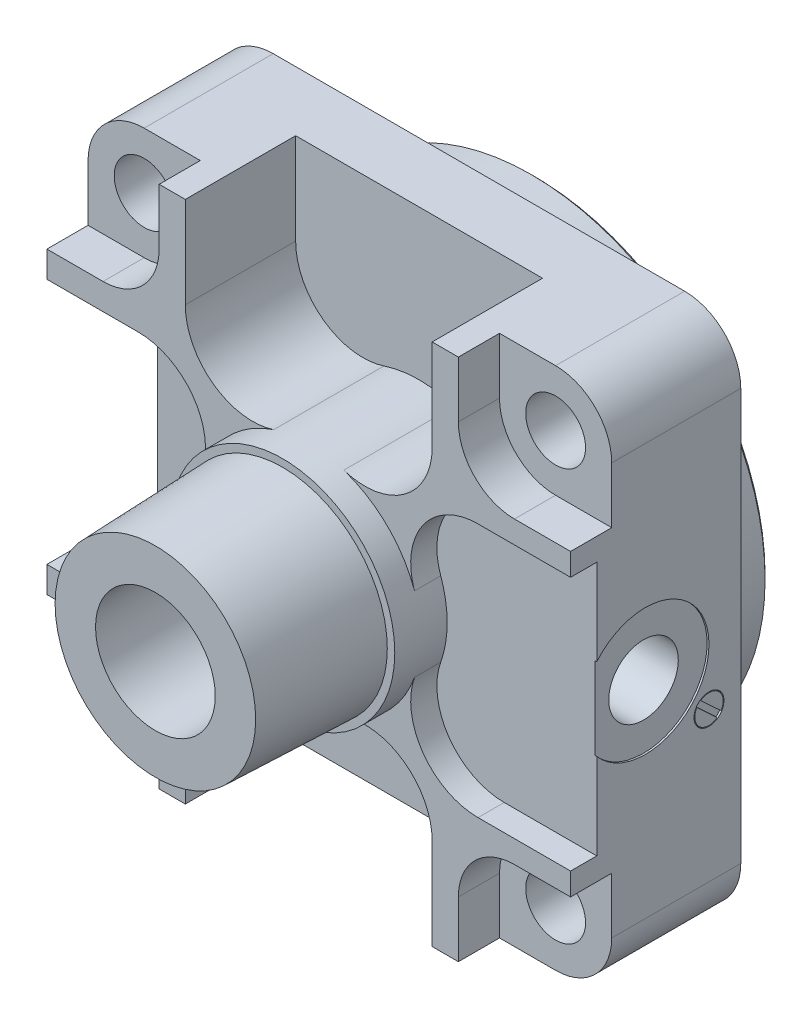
ISO-10303-21;
HEADER;
FILE_DESCRIPTION(('STEP AP214'),'2;1');
FILE_NAME('part.step','',(''),(''),'','','');
FILE_SCHEMA(('AUTOMOTIVE_DESIGN { 1 0 10303 214 1 1 1 1 }'));
ENDSEC;
DATA;
#1=APPLICATION_CONTEXT('core data for automotive mechanical design processes');
#2=APPLICATION_PROTOCOL_DEFINITION('international standard','automotive_design',2000,#1);
#3=PRODUCT_CONTEXT('',#1,'mechanical');
#4=PRODUCT('Part','Part','',(#3));
#5=PRODUCT_RELATED_PRODUCT_CATEGORY('part','',(#4));
#6=PRODUCT_DEFINITION_FORMATION('','',#4);
#7=PRODUCT_DEFINITION_CONTEXT('part definition',#1,'design');
#8=PRODUCT_DEFINITION('design','',#6,#7);
#9=PRODUCT_DEFINITION_SHAPE('','',#8);
#10=(LENGTH_UNIT() NAMED_UNIT(*) SI_UNIT(.MILLI.,.METRE.));
#11=(NAMED_UNIT(*) PLANE_ANGLE_UNIT() SI_UNIT($,.RADIAN.));
#12=(NAMED_UNIT(*) SI_UNIT($,.STERADIAN.) SOLID_ANGLE_UNIT());
#13=UNCERTAINTY_MEASURE_WITH_UNIT(LENGTH_MEASURE(1.E-05),#10,'distance_accuracy_value','');
#14=(GEOMETRIC_REPRESENTATION_CONTEXT(3) GLOBAL_UNCERTAINTY_ASSIGNED_CONTEXT((#13)) GLOBAL_UNIT_ASSIGNED_CONTEXT((#10,
#11,#12)) REPRESENTATION_CONTEXT('',''));
#15=CARTESIAN_POINT('',(0.,0.,0.));
#16=DIRECTION('',(0.,0.,1.));
#17=DIRECTION('',(1.,0.,0.));
#18=AXIS2_PLACEMENT_3D('',#15,#16,#17);
#19=CARTESIAN_POINT('',(-55.,55.,45.5));
#20=DIRECTION('',(0.,0.,1.));
#21=DIRECTION('',(1.,0.,0.));
#22=AXIS2_PLACEMENT_3D('',#19,#20,#21);
#23=PLANE('',#22);
#24=DIRECTION('',(0.,1.,0.));
#25=VECTOR('',#24,1.);
#26=CARTESIAN_POINT('',(33.,45.596052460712,45.5));
#27=LINE('',#26,#25);
#28=CARTESIAN_POINT('',(33.,45.596052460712,45.5));
#29=VERTEX_POINT('',#28);
#30=CARTESIAN_POINT('',(33.,70.,45.5));
#31=VERTEX_POINT('',#30);
#32=EDGE_CURVE('E727',#29,#31,#27,.T.);
#33=ORIENTED_EDGE('',*,*,#32,.F.);
#34=CARTESIAN_POINT('',(15.,45.596052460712,45.5));
#35=DIRECTION('',(0.,0.,1.));
#36=DIRECTION('',(1.,0.,0.));
#37=AXIS2_PLACEMENT_3D('',#34,#35,#36);
#38=CIRCLE('',#37,18.);
#39=CARTESIAN_POINT('',(9.37500000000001,28.497532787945,45.5));
#40=VERTEX_POINT('',#39);
#41=EDGE_CURVE('E730',#40,#29,#38,.T.);
#42=ORIENTED_EDGE('',*,*,#41,.F.);
#43=CARTESIAN_POINT('',(0.,0.,45.5));
#44=DIRECTION('',(0.,0.,1.));
#45=DIRECTION('',(1.,0.,0.));
#46=AXIS2_PLACEMENT_3D('',#43,#44,#45);
#47=CIRCLE('',#46,30.);
#48=CARTESIAN_POINT('',(28.2842712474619,10.,45.5));
#49=VERTEX_POINT('',#48);
#50=EDGE_CURVE('E1250',#49,#40,#47,.T.);
#51=ORIENTED_EDGE('',*,*,#50,.F.);
#52=CARTESIAN_POINT('',(45.254833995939,16.,45.5));
#53=DIRECTION('',(0.,0.,1.));
#54=DIRECTION('',(1.,0.,0.));
#55=AXIS2_PLACEMENT_3D('',#52,#53,#54);
#56=CIRCLE('',#55,18.);
#57=CARTESIAN_POINT('',(45.254833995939,34.,45.5));
#58=VERTEX_POINT('',#57);
#59=EDGE_CURVE('E828',#58,#49,#56,.T.);
#60=ORIENTED_EDGE('',*,*,#59,.F.);
#61=DIRECTION('',(-1.,0.,0.));
#62=VECTOR('',#61,1.);
#63=CARTESIAN_POINT('',(70.,34.,45.5));
#64=LINE('',#63,#62);
#65=CARTESIAN_POINT('',(70.,34.,45.5));
#66=VERTEX_POINT('',#65);
#67=EDGE_CURVE('E825',#66,#58,#64,.T.);
#68=ORIENTED_EDGE('',*,*,#67,.F.);
#69=DIRECTION('',(0.,1.,0.));
#70=VECTOR('',#69,1.);
#71=CARTESIAN_POINT('',(70.,-55.,45.5));
#72=LINE('',#71,#70);
#73=CARTESIAN_POINT('',(70.,40.,45.5));
#74=VERTEX_POINT('',#73);
#75=EDGE_CURVE('E1025',#66,#74,#72,.T.);
#76=ORIENTED_EDGE('',*,*,#75,.T.);
#77=DIRECTION('',(1.,0.,0.));
#78=VECTOR('',#77,1.);
#79=CARTESIAN_POINT('',(55.,40.,45.5));
#80=LINE('',#79,#78);
#81=CARTESIAN_POINT('',(55.,40.,45.5));
#82=VERTEX_POINT('',#81);
#83=EDGE_CURVE('E1185',#82,#74,#80,.T.);
#84=ORIENTED_EDGE('',*,*,#83,.F.);
#85=CARTESIAN_POINT('',(55.,55.,45.5));
#86=DIRECTION('',(0.,0.,1.));
#87=DIRECTION('',(1.,0.,0.));
#88=AXIS2_PLACEMENT_3D('',#85,#86,#87);
#89=CIRCLE('',#88,15.);
#90=CARTESIAN_POINT('',(40.,55.,45.5));
#91=VERTEX_POINT('',#90);
#92=EDGE_CURVE('E1182',#91,#82,#89,.T.);
#93=ORIENTED_EDGE('',*,*,#92,.F.);
#94=DIRECTION('',(0.,-1.,0.));
#95=VECTOR('',#94,1.);
#96=CARTESIAN_POINT('',(40.,55.,45.5));
#97=LINE('',#96,#95);
#98=CARTESIAN_POINT('',(40.,70.,45.5));
#99=VERTEX_POINT('',#98);
#100=EDGE_CURVE('E1127',#99,#91,#97,.T.);
#101=ORIENTED_EDGE('',*,*,#100,.F.);
#102=DIRECTION('',(-1.,0.,0.));
#103=VECTOR('',#102,1.);
#104=CARTESIAN_POINT('',(55.,70.,45.5));
#105=LINE('',#104,#103);
#106=EDGE_CURVE('E1034',#99,#31,#105,.T.);
#107=ORIENTED_EDGE('',*,*,#106,.T.);
#108=EDGE_LOOP('',(#33,#42,#51,#60,#68,#76,#84,#93,#101,#107));
#109=FACE_BOUND('',#108,.T.);
#110=ADVANCED_FACE('F348',(#109),#23,.T.);
#111=DIRECTION('',(0.,-1.,0.));
#112=VECTOR('',#111,1.);
#113=CARTESIAN_POINT('',(-33.,45.596052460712,45.5));
#114=LINE('',#113,#112);
#115=CARTESIAN_POINT('',(-33.,70.,45.5));
#116=VERTEX_POINT('',#115);
#117=CARTESIAN_POINT('',(-33.,45.596052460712,45.5));
#118=VERTEX_POINT('',#117);
#119=EDGE_CURVE('E736',#116,#118,#114,.T.);
#120=ORIENTED_EDGE('',*,*,#119,.F.);
#121=CARTESIAN_POINT('',(-40.,70.,45.5));
#122=VERTEX_POINT('',#121);
#123=EDGE_CURVE('E710',#116,#122,#105,.T.);
#124=ORIENTED_EDGE('',*,*,#123,.T.);
#125=DIRECTION('',(0.,1.,0.));
#126=VECTOR('',#125,1.);
#127=CARTESIAN_POINT('',(-40.,70.,45.5));
#128=LINE('',#127,#126);
#129=CARTESIAN_POINT('',(-40.,55.,45.5));
#130=VERTEX_POINT('',#129);
#131=EDGE_CURVE('E1217',#130,#122,#128,.T.);
#132=ORIENTED_EDGE('',*,*,#131,.F.);
#133=CARTESIAN_POINT('',(-55.,55.,45.5));
#134=DIRECTION('',(0.,0.,1.));
#135=DIRECTION('',(1.,0.,0.));
#136=AXIS2_PLACEMENT_3D('',#133,#134,#135);
#137=CIRCLE('',#136,15.);
#138=CARTESIAN_POINT('',(-55.,40.,45.5));
#139=VERTEX_POINT('',#138);
#140=EDGE_CURVE('E1214',#139,#130,#137,.T.);
#141=ORIENTED_EDGE('',*,*,#140,.F.);
#142=DIRECTION('',(1.,0.,0.));
#143=VECTOR('',#142,1.);
#144=CARTESIAN_POINT('',(-70.,40.,45.5));
#145=LINE('',#144,#143);
#146=CARTESIAN_POINT('',(-70.,40.,45.5));
#147=VERTEX_POINT('',#146);
#148=EDGE_CURVE('E1123',#147,#139,#145,.T.);
#149=ORIENTED_EDGE('',*,*,#148,.F.);
#150=DIRECTION('',(0.,-1.,0.));
#151=VECTOR('',#150,1.);
#152=CARTESIAN_POINT('',(-70.,55.,45.5));
#153=LINE('',#152,#151);
#154=CARTESIAN_POINT('',(-70.,33.,45.5));
#155=VERTEX_POINT('',#154);
#156=EDGE_CURVE('E1022',#147,#155,#153,.T.);
#157=ORIENTED_EDGE('',*,*,#156,.T.);
#158=DIRECTION('',(-1.,0.,0.));
#159=VECTOR('',#158,1.);
#160=CARTESIAN_POINT('',(-70.,33.,45.5));
#161=LINE('',#160,#159);
#162=CARTESIAN_POINT('',(-45.596052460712,33.,45.5));
#163=VERTEX_POINT('',#162);
#164=EDGE_CURVE('E743',#163,#155,#161,.T.);
#165=ORIENTED_EDGE('',*,*,#164,.F.);
#166=CARTESIAN_POINT('',(-45.596052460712,15.,45.5));
#167=DIRECTION('',(0.,0.,1.));
#168=DIRECTION('',(1.,0.,0.));
#169=AXIS2_PLACEMENT_3D('',#166,#167,#168);
#170=CIRCLE('',#169,18.);
#171=CARTESIAN_POINT('',(-28.497532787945,9.37500000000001,45.5));
#172=VERTEX_POINT('',#171);
#173=EDGE_CURVE('E769',#172,#163,#170,.T.);
#174=ORIENTED_EDGE('',*,*,#173,.F.);
#175=CARTESIAN_POINT('',(-9.37500000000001,28.497532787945,45.5));
#176=VERTEX_POINT('',#175);
#177=EDGE_CURVE('E1251',#176,#172,#47,.T.);
#178=ORIENTED_EDGE('',*,*,#177,.F.);
#179=CARTESIAN_POINT('',(-15.,45.596052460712,45.5));
#180=DIRECTION('',(0.,0.,1.));
#181=DIRECTION('',(1.,0.,0.));
#182=AXIS2_PLACEMENT_3D('',#179,#180,#181);
#183=CIRCLE('',#182,18.);
#184=EDGE_CURVE('E733',#118,#176,#183,.T.);
#185=ORIENTED_EDGE('',*,*,#184,.F.);
#186=EDGE_LOOP('',(#120,#124,#132,#141,#149,#157,#165,#174,#178,#185));
#187=FACE_BOUND('',#186,.T.);
#188=ADVANCED_FACE('F962',(#187),#23,.T.);
#189=CARTESIAN_POINT('',(15.,-45.596052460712,45.5));
#190=DIRECTION('',(0.,0.,1.));
#191=DIRECTION('',(1.,0.,0.));
#192=AXIS2_PLACEMENT_3D('',#189,#190,#191);
#193=CIRCLE('',#192,18.);
#194=CARTESIAN_POINT('',(33.,-45.596052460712,45.5));
#195=VERTEX_POINT('',#194);
#196=CARTESIAN_POINT('',(9.375,-28.497532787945,45.5));
#197=VERTEX_POINT('',#196);
#198=EDGE_CURVE('E772',#195,#197,#193,.T.);
#199=ORIENTED_EDGE('',*,*,#198,.F.);
#200=DIRECTION('',(0.,1.,0.));
#201=VECTOR('',#200,1.);
#202=CARTESIAN_POINT('',(33.,-70.,45.5));
#203=LINE('',#202,#201);
#204=CARTESIAN_POINT('',(33.,-70.,45.5));
#205=VERTEX_POINT('',#204);
#206=EDGE_CURVE('E785',#205,#195,#203,.T.);
#207=ORIENTED_EDGE('',*,*,#206,.F.);
#208=DIRECTION('',(1.,0.,0.));
#209=VECTOR('',#208,1.);
#210=CARTESIAN_POINT('',(-55.,-70.,45.5));
#211=LINE('',#210,#209);
#212=CARTESIAN_POINT('',(40.,-70.,45.5));
#213=VERTEX_POINT('',#212);
#214=EDGE_CURVE('E1016',#205,#213,#211,.T.);
#215=ORIENTED_EDGE('',*,*,#214,.T.);
#216=DIRECTION('',(0.,-1.,0.));
#217=VECTOR('',#216,1.);
#218=CARTESIAN_POINT('',(40.,-70.,45.5));
#219=LINE('',#218,#217);
#220=CARTESIAN_POINT('',(40.,-55.,45.5));
#221=VERTEX_POINT('',#220);
#222=EDGE_CURVE('E1155',#221,#213,#219,.T.);
#223=ORIENTED_EDGE('',*,*,#222,.F.);
#224=CARTESIAN_POINT('',(55.,-55.,45.5));
#225=DIRECTION('',(0.,0.,1.));
#226=DIRECTION('',(1.,0.,0.));
#227=AXIS2_PLACEMENT_3D('',#224,#225,#226);
#228=CIRCLE('',#227,15.);
#229=CARTESIAN_POINT('',(55.,-40.,45.5));
#230=VERTEX_POINT('',#229);
#231=EDGE_CURVE('E1135',#230,#221,#228,.T.);
#232=ORIENTED_EDGE('',*,*,#231,.F.);
#233=DIRECTION('',(-1.,0.,0.));
#234=VECTOR('',#233,1.);
#235=CARTESIAN_POINT('',(55.,-40.,45.5));
#236=LINE('',#235,#234);
#237=CARTESIAN_POINT('',(70.,-40.,45.5));
#238=VERTEX_POINT('',#237);
#239=EDGE_CURVE('E1130',#238,#230,#236,.T.);
#240=ORIENTED_EDGE('',*,*,#239,.F.);
#241=CARTESIAN_POINT('',(70.,-34.,45.5));
#242=VERTEX_POINT('',#241);
#243=EDGE_CURVE('E1031',#238,#242,#72,.T.);
#244=ORIENTED_EDGE('',*,*,#243,.T.);
#245=DIRECTION('',(1.,0.,0.));
#246=VECTOR('',#245,1.);
#247=CARTESIAN_POINT('',(70.,-34.,45.5));
#248=LINE('',#247,#246);
#249=CARTESIAN_POINT('',(45.254833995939,-34.,45.5));
#250=VERTEX_POINT('',#249);
#251=EDGE_CURVE('E823',#250,#242,#248,.T.);
#252=ORIENTED_EDGE('',*,*,#251,.F.);
#253=CARTESIAN_POINT('',(45.254833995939,-16.,45.5));
#254=DIRECTION('',(0.,0.,1.));
#255=DIRECTION('',(1.,0.,0.));
#256=AXIS2_PLACEMENT_3D('',#253,#254,#255);
#257=CIRCLE('',#256,18.);
#258=CARTESIAN_POINT('',(28.2842712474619,-10.,45.5));
#259=VERTEX_POINT('',#258);
#260=EDGE_CURVE('E808',#259,#250,#257,.T.);
#261=ORIENTED_EDGE('',*,*,#260,.F.);
#262=EDGE_CURVE('E1002',#197,#259,#47,.T.);
#263=ORIENTED_EDGE('',*,*,#262,.F.);
#264=EDGE_LOOP('',(#199,#207,#215,#223,#232,#240,#244,#252,#261,#263));
#265=FACE_BOUND('',#264,.T.);
#266=ADVANCED_FACE('F969',(#265),#23,.T.);
#267=CARTESIAN_POINT('',(69.5,0.,25.5));
#268=DIRECTION('',(1.,0.,0.));
#269=DIRECTION('',(0.,1.,0.));
#270=AXIS2_PLACEMENT_3D('',#267,#268,#269);
#271=CYLINDRICAL_SURFACE('',#270,17.);
#272=DIRECTION('',(1.,0.,0.));
#273=VECTOR('',#272,1.);
#274=CARTESIAN_POINT('',(69.5,-10.9544511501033,38.5));
#275=LINE('',#274,#273);
#276=CARTESIAN_POINT('',(70.,-10.9544511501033,38.5));
#277=VERTEX_POINT('',#276);
#278=CARTESIAN_POINT('',(69.5,-10.9544511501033,38.5));
#279=VERTEX_POINT('',#278);
#280=EDGE_CURVE('E865',#277,#279,#275,.F.);
#281=ORIENTED_EDGE('',*,*,#280,.F.);
#282=CARTESIAN_POINT('',(70.,0.,25.5));
#283=DIRECTION('',(1.,0.,0.));
#284=DIRECTION('',(0.,1.,0.));
#285=AXIS2_PLACEMENT_3D('',#282,#283,#284);
#286=CIRCLE('',#285,17.);
#287=CARTESIAN_POINT('',(70.,10.9544511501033,38.5));
#288=VERTEX_POINT('',#287);
#289=EDGE_CURVE('E1484',#277,#288,#286,.T.);
#290=ORIENTED_EDGE('',*,*,#289,.T.);
#291=DIRECTION('',(1.,0.,0.));
#292=VECTOR('',#291,1.);
#293=CARTESIAN_POINT('',(69.5,10.9544511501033,38.5));
#294=LINE('',#293,#292);
#295=CARTESIAN_POINT('',(69.5,10.9544511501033,38.5));
#296=VERTEX_POINT('',#295);
#297=EDGE_CURVE('E853',#296,#288,#294,.T.);
#298=ORIENTED_EDGE('',*,*,#297,.F.);
#299=CARTESIAN_POINT('',(69.5,0.,25.5));
#300=DIRECTION('',(1.,0.,0.));
#301=DIRECTION('',(0.,1.,0.));
#302=AXIS2_PLACEMENT_3D('',#299,#300,#301);
#303=CIRCLE('',#302,17.);
#304=EDGE_CURVE('E1428',#279,#296,#303,.T.);
#305=ORIENTED_EDGE('',*,*,#304,.F.);
#306=EDGE_LOOP('',(#281,#290,#298,#305));
#307=FACE_BOUND('',#306,.T.);
#308=ADVANCED_FACE('F989',(#307),#271,.F.);
#309=CARTESIAN_POINT('',(69.5,0.,25.5));
#310=DIRECTION('',(1.,0.,0.));
#311=DIRECTION('',(0.,1.,0.));
#312=AXIS2_PLACEMENT_3D('',#309,#310,#311);
#313=PLANE('',#312);
#314=CARTESIAN_POINT('',(69.5,0.,25.5));
#315=DIRECTION('',(1.,0.,0.));
#316=DIRECTION('',(0.,1.,0.));
#317=AXIS2_PLACEMENT_3D('',#314,#315,#316);
#318=CIRCLE('',#317,9.3);
#319=CARTESIAN_POINT('',(69.5,9.30000000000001,25.5));
#320=VERTEX_POINT('',#319);
#321=EDGE_CURVE('E867',#320,#320,#318,.T.);
#322=ORIENTED_EDGE('',*,*,#321,.F.);
#323=EDGE_LOOP('',(#322));
#324=FACE_BOUND('',#323,.T.);
#325=ORIENTED_EDGE('',*,*,#304,.T.);
#326=DIRECTION('',(0.,-1.,0.));
#327=VECTOR('',#326,1.);
#328=CARTESIAN_POINT('',(69.5,0.,38.5));
#329=LINE('',#328,#327);
#330=EDGE_CURVE('E11',#296,#279,#329,.T.);
#331=ORIENTED_EDGE('',*,*,#330,.T.);
#332=EDGE_LOOP('',(#325,#331));
#333=FACE_BOUND('',#332,.T.);
#334=ADVANCED_FACE('F994',(#324,#333),#313,.T.);
#335=CARTESIAN_POINT('',(69.5,-15.,8.5));
#336=DIRECTION('',(1.,0.,0.));
#337=DIRECTION('',(0.,1.,0.));
#338=AXIS2_PLACEMENT_3D('',#335,#336,#337);
#339=PLANE('',#338);
#340=DIRECTION('',(0.,-0.681230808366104,-0.732068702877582));
#341=VECTOR('',#340,1.);
#342=CARTESIAN_POINT('',(69.5,-11.9131922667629,10.7162170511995));
#343=LINE('',#342,#341);
#344=CARTESIAN_POINT('',(69.5,-11.9131922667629,10.7162170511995));
#345=VERTEX_POINT('',#344);
#346=CARTESIAN_POINT('',(69.5,-16.9887046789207,5.26193673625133));
#347=VERTEX_POINT('',#346);
#348=EDGE_CURVE('E1505',#345,#347,#343,.T.);
#349=ORIENTED_EDGE('',*,*,#348,.F.);
#350=CARTESIAN_POINT('',(69.5,-15.,8.5));
#351=DIRECTION('',(1.,0.,0.));
#352=DIRECTION('',(0.,1.,0.));
#353=AXIS2_PLACEMENT_3D('',#350,#351,#352);
#354=CIRCLE('',#353,3.8);
#355=EDGE_CURVE('E1507',#347,#345,#354,.T.);
#356=ORIENTED_EDGE('',*,*,#355,.F.);
#357=EDGE_LOOP('',(#349,#356));
#358=FACE_BOUND('',#357,.T.);
#359=CARTESIAN_POINT('',(69.5,-15.,8.5));
#360=DIRECTION('',(1.,0.,0.));
#361=DIRECTION('',(0.,1.,0.));
#362=AXIS2_PLACEMENT_3D('',#359,#360,#361);
#363=CIRCLE('',#362,4.);
#364=CARTESIAN_POINT('',(69.5,-11.,8.5));
#365=VERTEX_POINT('',#364);
#366=EDGE_CURVE('E1491',#365,#365,#363,.T.);
#367=ORIENTED_EDGE('',*,*,#366,.T.);
#368=EDGE_LOOP('',(#367));
#369=FACE_BOUND('',#368,.T.);
#370=DIRECTION('',(0.,0.681230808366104,0.732068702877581));
#371=VECTOR('',#370,1.);
#372=CARTESIAN_POINT('',(69.5,-18.0868077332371,6.28378294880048));
#373=LINE('',#372,#371);
#374=CARTESIAN_POINT('',(69.5,-18.0868077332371,6.28378294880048));
#375=VERTEX_POINT('',#374);
#376=CARTESIAN_POINT('',(69.5,-13.0112953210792,11.7380632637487));
#377=VERTEX_POINT('',#376);
#378=EDGE_CURVE('E1512',#375,#377,#373,.T.);
#379=ORIENTED_EDGE('',*,*,#378,.F.);
#380=CARTESIAN_POINT('',(69.5,-15.,8.5));
#381=DIRECTION('',(1.,0.,0.));
#382=DIRECTION('',(0.,1.,0.));
#383=AXIS2_PLACEMENT_3D('',#380,#381,#382);
#384=CIRCLE('',#383,3.8);
#385=EDGE_CURVE('E877',#377,#375,#384,.T.);
#386=ORIENTED_EDGE('',*,*,#385,.F.);
#387=EDGE_LOOP('',(#379,#386));
#388=FACE_BOUND('',#387,.T.);
#389=ADVANCED_FACE('F1387',(#358,#369,#388),#339,.T.);
#390=CARTESIAN_POINT('',(-55.,-55.,86.5));
#391=DIRECTION('',(0.,0.,-1.));
#392=DIRECTION('',(-1.,0.,0.));
#393=AXIS2_PLACEMENT_3D('',#390,#391,#392);
#394=CYLINDRICAL_SURFACE('',#393,15.);
#395=CARTESIAN_POINT('',(-55.,-55.,34.5));
#396=DIRECTION('',(0.,0.,1.));
#397=DIRECTION('',(1.,0.,0.));
#398=AXIS2_PLACEMENT_3D('',#395,#396,#397);
#399=CIRCLE('',#398,15.);
#400=CARTESIAN_POINT('',(-70.,-55.,34.5));
#401=VERTEX_POINT('',#400);
#402=CARTESIAN_POINT('',(-55.,-70.,34.5));
#403=VERTEX_POINT('',#402);
#404=EDGE_CURVE('E1265',#401,#403,#399,.T.);
#405=ORIENTED_EDGE('',*,*,#404,.F.);
#406=DIRECTION('',(0.,0.,-1.));
#407=VECTOR('',#406,1.);
#408=CARTESIAN_POINT('',(-70.,-55.,86.5));
#409=LINE('',#408,#407);
#410=CARTESIAN_POINT('',(-70.,-55.,0.));
#411=VERTEX_POINT('',#410);
#412=EDGE_CURVE('E1091',#401,#411,#409,.T.);
#413=ORIENTED_EDGE('',*,*,#412,.T.);
#414=CARTESIAN_POINT('',(-55.,-55.,0.));
#415=DIRECTION('',(0.,0.,1.));
#416=DIRECTION('',(1.,0.,0.));
#417=AXIS2_PLACEMENT_3D('',#414,#415,#416);
#418=CIRCLE('',#417,15.);
#419=CARTESIAN_POINT('',(-55.,-70.,0.));
#420=VERTEX_POINT('',#419);
#421=EDGE_CURVE('E1061',#411,#420,#418,.T.);
#422=ORIENTED_EDGE('',*,*,#421,.T.);
#423=DIRECTION('',(0.,0.,-1.));
#424=VECTOR('',#423,1.);
#425=CARTESIAN_POINT('',(-55.,-70.,86.5));
#426=LINE('',#425,#424);
#427=EDGE_CURVE('E1089',#403,#420,#426,.T.);
#428=ORIENTED_EDGE('',*,*,#427,.F.);
#429=EDGE_LOOP('',(#405,#413,#422,#428));
#430=FACE_BOUND('',#429,.T.);
#431=ADVANCED_FACE('F1268',(#430),#394,.T.);
#432=CARTESIAN_POINT('',(-55.,-55.,86.5));
#433=DIRECTION('',(0.,0.,-1.));
#434=DIRECTION('',(-1.,0.,0.));
#435=AXIS2_PLACEMENT_3D('',#432,#433,#434);
#436=CYLINDRICAL_SURFACE('',#435,8.);
#437=CARTESIAN_POINT('',(-55.,-55.,0.));
#438=DIRECTION('',(0.,0.,1.));
#439=DIRECTION('',(1.,0.,0.));
#440=AXIS2_PLACEMENT_3D('',#437,#438,#439);
#441=CIRCLE('',#440,8.);
#442=CARTESIAN_POINT('',(-47.,-55.,0.));
#443=VERTEX_POINT('',#442);
#444=EDGE_CURVE('E1040',#443,#443,#441,.T.);
#445=ORIENTED_EDGE('',*,*,#444,.F.);
#446=EDGE_LOOP('',(#445));
#447=FACE_BOUND('',#446,.T.);
#448=CARTESIAN_POINT('',(-55.,-55.,34.5));
#449=DIRECTION('',(0.,0.,1.));
#450=DIRECTION('',(1.,0.,0.));
#451=AXIS2_PLACEMENT_3D('',#448,#449,#450);
#452=CIRCLE('',#451,8.);
#453=CARTESIAN_POINT('',(-47.,-55.,34.5));
#454=VERTEX_POINT('',#453);
#455=EDGE_CURVE('E1128',#454,#454,#452,.T.);
#456=ORIENTED_EDGE('',*,*,#455,.T.);
#457=EDGE_LOOP('',(#456));
#458=FACE_BOUND('',#457,.T.);
#459=ADVANCED_FACE('F1383',(#447,#458),#436,.F.);
#460=CARTESIAN_POINT('',(55.,-55.,86.5));
#461=DIRECTION('',(0.,0.,-1.));
#462=DIRECTION('',(-1.,0.,0.));
#463=AXIS2_PLACEMENT_3D('',#460,#461,#462);
#464=CYLINDRICAL_SURFACE('',#463,15.);
#465=CARTESIAN_POINT('',(55.,-55.,34.5));
#466=DIRECTION('',(0.,0.,1.));
#467=DIRECTION('',(1.,0.,0.));
#468=AXIS2_PLACEMENT_3D('',#465,#466,#467);
#469=CIRCLE('',#468,15.);
#470=CARTESIAN_POINT('',(55.,-70.,34.5));
#471=VERTEX_POINT('',#470);
#472=CARTESIAN_POINT('',(70.,-55.,34.5));
#473=VERTEX_POINT('',#472);
#474=EDGE_CURVE('E1159',#471,#473,#469,.T.);
#475=ORIENTED_EDGE('',*,*,#474,.F.);
#476=DIRECTION('',(0.,0.,-1.));
#477=VECTOR('',#476,1.);
#478=CARTESIAN_POINT('',(55.,-70.,86.5));
#479=LINE('',#478,#477);
#480=CARTESIAN_POINT('',(55.,-70.,0.));
#481=VERTEX_POINT('',#480);
#482=EDGE_CURVE('E1087',#471,#481,#479,.T.);
#483=ORIENTED_EDGE('',*,*,#482,.T.);
#484=CARTESIAN_POINT('',(55.,-55.,0.));
#485=DIRECTION('',(0.,0.,1.));
#486=DIRECTION('',(1.,0.,0.));
#487=AXIS2_PLACEMENT_3D('',#484,#485,#486);
#488=CIRCLE('',#487,15.);
#489=CARTESIAN_POINT('',(70.,-55.,0.));
#490=VERTEX_POINT('',#489);
#491=EDGE_CURVE('E1067',#481,#490,#488,.T.);
#492=ORIENTED_EDGE('',*,*,#491,.T.);
#493=DIRECTION('',(0.,0.,-1.));
#494=VECTOR('',#493,1.);
#495=CARTESIAN_POINT('',(70.,-55.,86.5));
#496=LINE('',#495,#494);
#497=EDGE_CURVE('E1085',#473,#490,#496,.T.);
#498=ORIENTED_EDGE('',*,*,#497,.F.);
#499=EDGE_LOOP('',(#475,#483,#492,#498));
#500=FACE_BOUND('',#499,.T.);
#501=ADVANCED_FACE('F1282',(#500),#464,.T.);
#502=CARTESIAN_POINT('',(55.,-55.,86.5));
#503=DIRECTION('',(0.,0.,-1.));
#504=DIRECTION('',(-1.,0.,0.));
#505=AXIS2_PLACEMENT_3D('',#502,#503,#504);
#506=CYLINDRICAL_SURFACE('',#505,8.00000000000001);
#507=CARTESIAN_POINT('',(55.,-55.,0.));
#508=DIRECTION('',(0.,0.,1.));
#509=DIRECTION('',(1.,0.,0.));
#510=AXIS2_PLACEMENT_3D('',#507,#508,#509);
#511=CIRCLE('',#510,8.00000000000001);
#512=CARTESIAN_POINT('',(63.,-55.,0.));
#513=VERTEX_POINT('',#512);
#514=EDGE_CURVE('E1043',#513,#513,#511,.T.);
#515=ORIENTED_EDGE('',*,*,#514,.F.);
#516=EDGE_LOOP('',(#515));
#517=FACE_BOUND('',#516,.T.);
#518=CARTESIAN_POINT('',(55.,-55.,34.5));
#519=DIRECTION('',(0.,0.,1.));
#520=DIRECTION('',(1.,0.,0.));
#521=AXIS2_PLACEMENT_3D('',#518,#519,#520);
#522=CIRCLE('',#521,8.00000000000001);
#523=CARTESIAN_POINT('',(63.,-55.,34.5));
#524=VERTEX_POINT('',#523);
#525=EDGE_CURVE('E1125',#524,#524,#522,.T.);
#526=ORIENTED_EDGE('',*,*,#525,.T.);
#527=EDGE_LOOP('',(#526));
#528=FACE_BOUND('',#527,.T.);
#529=ADVANCED_FACE('F1376',(#517,#528),#506,.F.);
#530=CARTESIAN_POINT('',(55.,55.,86.5));
#531=DIRECTION('',(0.,0.,-1.));
#532=DIRECTION('',(-1.,0.,0.));
#533=AXIS2_PLACEMENT_3D('',#530,#531,#532);
#534=CYLINDRICAL_SURFACE('',#533,15.);
#535=CARTESIAN_POINT('',(55.,55.,34.5));
#536=DIRECTION('',(0.,0.,1.));
#537=DIRECTION('',(1.,0.,0.));
#538=AXIS2_PLACEMENT_3D('',#535,#536,#537);
#539=CIRCLE('',#538,15.);
#540=CARTESIAN_POINT('',(70.,55.,34.5));
#541=VERTEX_POINT('',#540);
#542=CARTESIAN_POINT('',(55.,70.,34.5));
#543=VERTEX_POINT('',#542);
#544=EDGE_CURVE('E1190',#541,#543,#539,.T.);
#545=ORIENTED_EDGE('',*,*,#544,.F.);
#546=DIRECTION('',(0.,0.,-1.));
#547=VECTOR('',#546,1.);
#548=CARTESIAN_POINT('',(70.,55.,86.5));
#549=LINE('',#548,#547);
#550=CARTESIAN_POINT('',(70.,55.,0.));
#551=VERTEX_POINT('',#550);
#552=EDGE_CURVE('E1083',#541,#551,#549,.T.);
#553=ORIENTED_EDGE('',*,*,#552,.T.);
#554=CARTESIAN_POINT('',(55.,55.,0.));
#555=DIRECTION('',(0.,0.,1.));
#556=DIRECTION('',(1.,0.,0.));
#557=AXIS2_PLACEMENT_3D('',#554,#555,#556);
#558=CIRCLE('',#557,15.);
#559=CARTESIAN_POINT('',(55.,70.,0.));
#560=VERTEX_POINT('',#559);
#561=EDGE_CURVE('E1073',#551,#560,#558,.T.);
#562=ORIENTED_EDGE('',*,*,#561,.T.);
#563=DIRECTION('',(0.,0.,-1.));
#564=VECTOR('',#563,1.);
#565=CARTESIAN_POINT('',(55.,70.,86.5));
#566=LINE('',#565,#564);
#567=EDGE_CURVE('E1081',#543,#560,#566,.T.);
#568=ORIENTED_EDGE('',*,*,#567,.F.);
#569=EDGE_LOOP('',(#545,#553,#562,#568));
#570=FACE_BOUND('',#569,.T.);
#571=ADVANCED_FACE('F1372',(#570),#534,.T.);
#572=CARTESIAN_POINT('',(55.,55.,86.5));
#573=DIRECTION('',(0.,0.,-1.));
#574=DIRECTION('',(-1.,0.,0.));
#575=AXIS2_PLACEMENT_3D('',#572,#573,#574);
#576=CYLINDRICAL_SURFACE('',#575,8.00000000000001);
#577=CARTESIAN_POINT('',(55.,55.,0.));
#578=DIRECTION('',(0.,0.,1.));
#579=DIRECTION('',(1.,0.,0.));
#580=AXIS2_PLACEMENT_3D('',#577,#578,#579);
#581=CIRCLE('',#580,8.00000000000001);
#582=CARTESIAN_POINT('',(63.,55.,0.));
#583=VERTEX_POINT('',#582);
#584=EDGE_CURVE('E1046',#583,#583,#581,.T.);
#585=ORIENTED_EDGE('',*,*,#584,.F.);
#586=EDGE_LOOP('',(#585));
#587=FACE_BOUND('',#586,.T.);
#588=CARTESIAN_POINT('',(55.,55.,34.5));
#589=DIRECTION('',(0.,0.,1.));
#590=DIRECTION('',(1.,0.,0.));
#591=AXIS2_PLACEMENT_3D('',#588,#589,#590);
#592=CIRCLE('',#591,8.00000000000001);
#593=CARTESIAN_POINT('',(63.,55.,34.5));
#594=VERTEX_POINT('',#593);
#595=EDGE_CURVE('E1120',#594,#594,#592,.T.);
#596=ORIENTED_EDGE('',*,*,#595,.T.);
#597=EDGE_LOOP('',(#596));
#598=FACE_BOUND('',#597,.T.);
#599=ADVANCED_FACE('F1375',(#587,#598),#576,.F.);
#600=CARTESIAN_POINT('',(-55.,55.,86.5));
#601=DIRECTION('',(0.,0.,-1.));
#602=DIRECTION('',(-1.,0.,0.));
#603=AXIS2_PLACEMENT_3D('',#600,#601,#602);
#604=CYLINDRICAL_SURFACE('',#603,15.);
#605=CARTESIAN_POINT('',(-55.,55.,34.5));
#606=DIRECTION('',(0.,0.,1.));
#607=DIRECTION('',(1.,0.,0.));
#608=AXIS2_PLACEMENT_3D('',#605,#606,#607);
#609=CIRCLE('',#608,15.);
#610=CARTESIAN_POINT('',(-55.,70.,34.5));
#611=VERTEX_POINT('',#610);
#612=CARTESIAN_POINT('',(-70.,55.,34.5));
#613=VERTEX_POINT('',#612);
#614=EDGE_CURVE('E1222',#611,#613,#609,.T.);
#615=ORIENTED_EDGE('',*,*,#614,.F.);
#616=DIRECTION('',(0.,0.,-1.));
#617=VECTOR('',#616,1.);
#618=CARTESIAN_POINT('',(-55.,70.,86.5));
#619=LINE('',#618,#617);
#620=CARTESIAN_POINT('',(-55.,70.,0.));
#621=VERTEX_POINT('',#620);
#622=EDGE_CURVE('E1079',#611,#621,#619,.T.);
#623=ORIENTED_EDGE('',*,*,#622,.T.);
#624=CARTESIAN_POINT('',(-55.,55.,0.));
#625=DIRECTION('',(0.,0.,1.));
#626=DIRECTION('',(1.,0.,0.));
#627=AXIS2_PLACEMENT_3D('',#624,#625,#626);
#628=CIRCLE('',#627,15.);
#629=CARTESIAN_POINT('',(-70.,55.,0.));
#630=VERTEX_POINT('',#629);
#631=EDGE_CURVE('E1055',#621,#630,#628,.T.);
#632=ORIENTED_EDGE('',*,*,#631,.T.);
#633=DIRECTION('',(0.,0.,-1.));
#634=VECTOR('',#633,1.);
#635=CARTESIAN_POINT('',(-70.,55.,86.5));
#636=LINE('',#635,#634);
#637=EDGE_CURVE('E1093',#613,#630,#636,.T.);
#638=ORIENTED_EDGE('',*,*,#637,.F.);
#639=EDGE_LOOP('',(#615,#623,#632,#638));
#640=FACE_BOUND('',#639,.T.);
#641=ADVANCED_FACE('F350',(#640),#604,.T.);
#642=CARTESIAN_POINT('',(-55.,55.,86.5));
#643=DIRECTION('',(0.,0.,-1.));
#644=DIRECTION('',(-1.,0.,0.));
#645=AXIS2_PLACEMENT_3D('',#642,#643,#644);
#646=CYLINDRICAL_SURFACE('',#645,8.);
#647=CARTESIAN_POINT('',(-55.,55.,0.));
#648=DIRECTION('',(0.,0.,1.));
#649=DIRECTION('',(1.,0.,0.));
#650=AXIS2_PLACEMENT_3D('',#647,#648,#649);
#651=CIRCLE('',#650,8.);
#652=CARTESIAN_POINT('',(-47.,55.,0.));
#653=VERTEX_POINT('',#652);
#654=EDGE_CURVE('E1049',#653,#653,#651,.T.);
#655=ORIENTED_EDGE('',*,*,#654,.F.);
#656=EDGE_LOOP('',(#655));
#657=FACE_BOUND('',#656,.T.);
#658=CARTESIAN_POINT('',(-55.,55.,34.5));
#659=DIRECTION('',(0.,0.,1.));
#660=DIRECTION('',(1.,0.,0.));
#661=AXIS2_PLACEMENT_3D('',#658,#659,#660);
#662=CIRCLE('',#661,8.);
#663=CARTESIAN_POINT('',(-47.,55.,34.5));
#664=VERTEX_POINT('',#663);
#665=EDGE_CURVE('E1115',#664,#664,#662,.T.);
#666=ORIENTED_EDGE('',*,*,#665,.T.);
#667=EDGE_LOOP('',(#666));
#668=FACE_BOUND('',#667,.T.);
#669=ADVANCED_FACE('F1356',(#657,#668),#646,.F.);
#670=CARTESIAN_POINT('',(-55.,55.,86.5));
#671=DIRECTION('',(0.,0.,1.));
#672=DIRECTION('',(1.,0.,0.));
#673=AXIS2_PLACEMENT_3D('',#670,#671,#672);
#674=PLANE('',#673);
#675=CARTESIAN_POINT('',(0.,0.,86.5));
#676=DIRECTION('',(0.,0.,1.));
#677=DIRECTION('',(1.,0.,0.));
#678=AXIS2_PLACEMENT_3D('',#675,#676,#677);
#679=CIRCLE('',#678,16.);
#680=CARTESIAN_POINT('',(16.,0.,86.5));
#681=VERTEX_POINT('',#680);
#682=EDGE_CURVE('E1052',#681,#681,#679,.T.);
#683=ORIENTED_EDGE('',*,*,#682,.F.);
#684=EDGE_LOOP('',(#683));
#685=FACE_BOUND('',#684,.T.);
#686=CARTESIAN_POINT('',(0.,0.,86.5));
#687=DIRECTION('',(0.,0.,1.));
#688=DIRECTION('',(1.,0.,0.));
#689=AXIS2_PLACEMENT_3D('',#686,#687,#688);
#690=CIRCLE('',#689,26.8126938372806);
#691=CARTESIAN_POINT('',(26.8126938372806,0.,86.5));
#692=VERTEX_POINT('',#691);
#693=EDGE_CURVE('E1248',#692,#692,#690,.T.);
#694=ORIENTED_EDGE('',*,*,#693,.T.);
#695=EDGE_LOOP('',(#694));
#696=FACE_BOUND('',#695,.T.);
#697=ADVANCED_FACE('F1350',(#685,#696),#674,.T.);
#698=CARTESIAN_POINT('',(0.,0.,45.5));
#699=DIRECTION('',(0.,0.,1.));
#700=DIRECTION('',(1.,0.,0.));
#701=AXIS2_PLACEMENT_3D('',#698,#699,#700);
#702=CYLINDRICAL_SURFACE('',#701,30.);
#703=ORIENTED_EDGE('',*,*,#50,.T.);
#704=DIRECTION('',(0.,0.,1.));
#705=VECTOR('',#704,1.);
#706=CARTESIAN_POINT('',(9.37500000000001,28.497532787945,16.));
#707=LINE('',#706,#705);
#708=CARTESIAN_POINT('',(9.37500000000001,28.497532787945,16.));
#709=VERTEX_POINT('',#708);
#710=EDGE_CURVE('E723',#709,#40,#707,.T.);
#711=ORIENTED_EDGE('',*,*,#710,.F.);
#712=CARTESIAN_POINT('',(0.,0.,16.));
#713=DIRECTION('',(0.,0.,-1.));
#714=DIRECTION('',(1.,0.,0.));
#715=AXIS2_PLACEMENT_3D('',#712,#713,#714);
#716=CIRCLE('',#715,30.);
#717=CARTESIAN_POINT('',(-9.37500000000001,28.497532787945,16.));
#718=VERTEX_POINT('',#717);
#719=EDGE_CURVE('E720',#718,#709,#716,.T.);
#720=ORIENTED_EDGE('',*,*,#719,.F.);
#721=DIRECTION('',(0.,0.,1.));
#722=VECTOR('',#721,1.);
#723=CARTESIAN_POINT('',(-9.37500000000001,28.497532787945,16.));
#724=LINE('',#723,#722);
#725=EDGE_CURVE('E725',#718,#176,#724,.T.);
#726=ORIENTED_EDGE('',*,*,#725,.T.);
#727=ORIENTED_EDGE('',*,*,#177,.T.);
#728=DIRECTION('',(0.,0.,1.));
#729=VECTOR('',#728,1.);
#730=CARTESIAN_POINT('',(-28.497532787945,9.37500000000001,16.));
#731=LINE('',#730,#729);
#732=CARTESIAN_POINT('',(-28.497532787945,9.37500000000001,16.));
#733=VERTEX_POINT('',#732);
#734=EDGE_CURVE('E751',#733,#172,#731,.T.);
#735=ORIENTED_EDGE('',*,*,#734,.F.);
#736=CARTESIAN_POINT('',(0.,0.,16.));
#737=DIRECTION('',(0.,0.,-1.));
#738=DIRECTION('',(1.,0.,0.));
#739=AXIS2_PLACEMENT_3D('',#736,#737,#738);
#740=CIRCLE('',#739,30.);
#741=CARTESIAN_POINT('',(-28.497532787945,-9.37500000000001,16.));
#742=VERTEX_POINT('',#741);
#743=EDGE_CURVE('E754',#742,#733,#740,.T.);
#744=ORIENTED_EDGE('',*,*,#743,.F.);
#745=DIRECTION('',(0.,0.,1.));
#746=VECTOR('',#745,1.);
#747=CARTESIAN_POINT('',(-28.497532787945,-9.37500000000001,16.));
#748=LINE('',#747,#746);
#749=CARTESIAN_POINT('',(-28.497532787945,-9.37500000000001,45.5));
#750=VERTEX_POINT('',#749);
#751=EDGE_CURVE('E748',#742,#750,#748,.T.);
#752=ORIENTED_EDGE('',*,*,#751,.T.);
#753=CARTESIAN_POINT('',(-9.37500000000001,-28.497532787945,45.5));
#754=VERTEX_POINT('',#753);
#755=EDGE_CURVE('E1253',#750,#754,#47,.T.);
#756=ORIENTED_EDGE('',*,*,#755,.T.);
#757=DIRECTION('',(0.,0.,1.));
#758=VECTOR('',#757,1.);
#759=CARTESIAN_POINT('',(-9.37500000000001,-28.497532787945,16.));
#760=LINE('',#759,#758);
#761=CARTESIAN_POINT('',(-9.37500000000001,-28.497532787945,16.));
#762=VERTEX_POINT('',#761);
#763=EDGE_CURVE('E816',#762,#754,#760,.T.);
#764=ORIENTED_EDGE('',*,*,#763,.F.);
#765=CARTESIAN_POINT('',(0.,0.,16.));
#766=DIRECTION('',(0.,0.,-1.));
#767=DIRECTION('',(1.,0.,0.));
#768=AXIS2_PLACEMENT_3D('',#765,#766,#767);
#769=CIRCLE('',#768,30.);
#770=CARTESIAN_POINT('',(9.375,-28.497532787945,16.));
#771=VERTEX_POINT('',#770);
#772=EDGE_CURVE('E791',#771,#762,#769,.T.);
#773=ORIENTED_EDGE('',*,*,#772,.F.);
#774=DIRECTION('',(0.,0.,1.));
#775=VECTOR('',#774,1.);
#776=CARTESIAN_POINT('',(9.375,-28.497532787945,16.));
#777=LINE('',#776,#775);
#778=EDGE_CURVE('E805',#771,#197,#777,.T.);
#779=ORIENTED_EDGE('',*,*,#778,.T.);
#780=ORIENTED_EDGE('',*,*,#262,.T.);
#781=DIRECTION('',(0.,0.,1.));
#782=VECTOR('',#781,1.);
#783=CARTESIAN_POINT('',(28.2842712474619,-10.,38.5));
#784=LINE('',#783,#782);
#785=CARTESIAN_POINT('',(28.2842712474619,-10.,38.5));
#786=VERTEX_POINT('',#785);
#787=EDGE_CURVE('E850',#786,#259,#784,.T.);
#788=ORIENTED_EDGE('',*,*,#787,.F.);
#789=CARTESIAN_POINT('',(0.,0.,38.5));
#790=DIRECTION('',(0.,0.,-1.));
#791=DIRECTION('',(1.,0.,0.));
#792=AXIS2_PLACEMENT_3D('',#789,#790,#791);
#793=CIRCLE('',#792,30.);
#794=CARTESIAN_POINT('',(28.2842712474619,10.,38.5));
#795=VERTEX_POINT('',#794);
#796=EDGE_CURVE('E846',#795,#786,#793,.T.);
#797=ORIENTED_EDGE('',*,*,#796,.F.);
#798=DIRECTION('',(0.,0.,1.));
#799=VECTOR('',#798,1.);
#800=CARTESIAN_POINT('',(28.2842712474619,10.,38.5));
#801=LINE('',#800,#799);
#802=EDGE_CURVE('E854',#795,#49,#801,.T.);
#803=ORIENTED_EDGE('',*,*,#802,.T.);
#804=EDGE_LOOP('',(#703,#711,#720,#726,#727,#735,#744,#752,#756,#764,#773,#779,#780,#788,#797,#803));
#805=FACE_BOUND('',#804,.T.);
#806=CARTESIAN_POINT('',(0.,0.,52.5));
#807=DIRECTION('',(0.,0.,1.));
#808=DIRECTION('',(1.,0.,0.));
#809=AXIS2_PLACEMENT_3D('',#806,#807,#808);
#810=CIRCLE('',#809,30.);
#811=CARTESIAN_POINT('',(30.,0.,52.5));
#812=VERTEX_POINT('',#811);
#813=EDGE_CURVE('E1118',#812,#812,#810,.T.);
#814=ORIENTED_EDGE('',*,*,#813,.F.);
#815=EDGE_LOOP('',(#814));
#816=FACE_BOUND('',#815,.T.);
#817=ADVANCED_FACE('F1007',(#805,#816),#702,.T.);
#818=CARTESIAN_POINT('',(-70.,55.,86.5));
#819=DIRECTION('',(1.,0.,0.));
#820=DIRECTION('',(0.,1.,0.));
#821=AXIS2_PLACEMENT_3D('',#818,#819,#820);
#822=PLANE('',#821);
#823=DIRECTION('',(0.,-1.,0.));
#824=VECTOR('',#823,1.);
#825=CARTESIAN_POINT('',(-70.,33.,16.));
#826=LINE('',#825,#824);
#827=CARTESIAN_POINT('',(-70.,33.,16.));
#828=VERTEX_POINT('',#827);
#829=CARTESIAN_POINT('',(-70.,-33.,16.));
#830=VERTEX_POINT('',#829);
#831=EDGE_CURVE('E744',#828,#830,#826,.T.);
#832=ORIENTED_EDGE('',*,*,#831,.F.);
#833=DIRECTION('',(0.,0.,1.));
#834=VECTOR('',#833,1.);
#835=CARTESIAN_POINT('',(-70.,33.,16.));
#836=LINE('',#835,#834);
#837=EDGE_CURVE('E738',#828,#155,#836,.T.);
#838=ORIENTED_EDGE('',*,*,#837,.T.);
#839=ORIENTED_EDGE('',*,*,#156,.F.);
#840=DIRECTION('',(0.,0.,1.));
#841=VECTOR('',#840,1.);
#842=CARTESIAN_POINT('',(-70.,40.,34.5));
#843=LINE('',#842,#841);
#844=CARTESIAN_POINT('',(-70.,40.,34.5));
#845=VERTEX_POINT('',#844);
#846=EDGE_CURVE('E1236',#845,#147,#843,.T.);
#847=ORIENTED_EDGE('',*,*,#846,.F.);
#848=DIRECTION('',(0.,-1.,0.));
#849=VECTOR('',#848,1.);
#850=CARTESIAN_POINT('',(-70.,55.,34.5));
#851=LINE('',#850,#849);
#852=EDGE_CURVE('E1224',#613,#845,#851,.T.);
#853=ORIENTED_EDGE('',*,*,#852,.F.);
#854=ORIENTED_EDGE('',*,*,#637,.T.);
#855=DIRECTION('',(0.,-1.,0.));
#856=VECTOR('',#855,1.);
#857=CARTESIAN_POINT('',(-70.,55.,0.));
#858=LINE('',#857,#856);
#859=EDGE_CURVE('E1058',#630,#411,#858,.T.);
#860=ORIENTED_EDGE('',*,*,#859,.T.);
#861=ORIENTED_EDGE('',*,*,#412,.F.);
#862=DIRECTION('',(0.,-1.,0.));
#863=VECTOR('',#862,1.);
#864=CARTESIAN_POINT('',(-70.,-40.,34.5));
#865=LINE('',#864,#863);
#866=CARTESIAN_POINT('',(-70.,-40.,34.5));
#867=VERTEX_POINT('',#866);
#868=EDGE_CURVE('E1446',#867,#401,#865,.T.);
#869=ORIENTED_EDGE('',*,*,#868,.F.);
#870=DIRECTION('',(0.,0.,1.));
#871=VECTOR('',#870,1.);
#872=CARTESIAN_POINT('',(-70.,-40.,34.5));
#873=LINE('',#872,#871);
#874=CARTESIAN_POINT('',(-70.,-40.,45.5));
#875=VERTEX_POINT('',#874);
#876=EDGE_CURVE('E1137',#867,#875,#873,.T.);
#877=ORIENTED_EDGE('',*,*,#876,.T.);
#878=CARTESIAN_POINT('',(-70.,-33.,45.5));
#879=VERTEX_POINT('',#878);
#880=EDGE_CURVE('E1027',#879,#875,#153,.T.);
#881=ORIENTED_EDGE('',*,*,#880,.F.);
#882=DIRECTION('',(0.,0.,1.));
#883=VECTOR('',#882,1.);
#884=CARTESIAN_POINT('',(-70.,-33.,16.));
#885=LINE('',#884,#883);
#886=EDGE_CURVE('E371',#830,#879,#885,.T.);
#887=ORIENTED_EDGE('',*,*,#886,.F.);
#888=EDGE_LOOP('',(#832,#838,#839,#847,#853,#854,#860,#861,#869,#877,#881,#887));
#889=FACE_BOUND('',#888,.T.);
#890=ADVANCED_FACE('F1349',(#889),#822,.F.);
#891=CARTESIAN_POINT('',(-55.,-70.,86.5));
#892=DIRECTION('',(0.,1.,0.));
#893=DIRECTION('',(-1.,0.,0.));
#894=AXIS2_PLACEMENT_3D('',#891,#892,#893);
#895=PLANE('',#894);
#896=ORIENTED_EDGE('',*,*,#214,.F.);
#897=DIRECTION('',(0.,0.,1.));
#898=VECTOR('',#897,1.);
#899=CARTESIAN_POINT('',(33.,-70.,16.));
#900=LINE('',#899,#898);
#901=CARTESIAN_POINT('',(33.,-70.,16.));
#902=VERTEX_POINT('',#901);
#903=EDGE_CURVE('E809',#902,#205,#900,.T.);
#904=ORIENTED_EDGE('',*,*,#903,.F.);
#905=DIRECTION('',(1.,0.,0.));
#906=VECTOR('',#905,1.);
#907=CARTESIAN_POINT('',(-33.,-70.,16.));
#908=LINE('',#907,#906);
#909=CARTESIAN_POINT('',(-33.,-70.,16.));
#910=VERTEX_POINT('',#909);
#911=EDGE_CURVE('E800',#910,#902,#908,.T.);
#912=ORIENTED_EDGE('',*,*,#911,.F.);
#913=DIRECTION('',(0.,0.,1.));
#914=VECTOR('',#913,1.);
#915=CARTESIAN_POINT('',(-33.,-70.,16.));
#916=LINE('',#915,#914);
#917=CARTESIAN_POINT('',(-33.,-70.,45.5));
#918=VERTEX_POINT('',#917);
#919=EDGE_CURVE('E811',#910,#918,#916,.T.);
#920=ORIENTED_EDGE('',*,*,#919,.T.);
#921=CARTESIAN_POINT('',(-40.,-70.,45.5));
#922=VERTEX_POINT('',#921);
#923=EDGE_CURVE('E1021',#922,#918,#211,.T.);
#924=ORIENTED_EDGE('',*,*,#923,.F.);
#925=DIRECTION('',(0.,0.,1.));
#926=VECTOR('',#925,1.);
#927=CARTESIAN_POINT('',(-40.,-70.,34.5));
#928=LINE('',#927,#926);
#929=CARTESIAN_POINT('',(-40.,-70.,34.5));
#930=VERTEX_POINT('',#929);
#931=EDGE_CURVE('E1131',#930,#922,#928,.T.);
#932=ORIENTED_EDGE('',*,*,#931,.F.);
#933=DIRECTION('',(1.,0.,0.));
#934=VECTOR('',#933,1.);
#935=CARTESIAN_POINT('',(-55.,-70.,34.5));
#936=LINE('',#935,#934);
#937=EDGE_CURVE('E1146',#403,#930,#936,.T.);
#938=ORIENTED_EDGE('',*,*,#937,.F.);
#939=ORIENTED_EDGE('',*,*,#427,.T.);
#940=DIRECTION('',(1.,0.,0.));
#941=VECTOR('',#940,1.);
#942=CARTESIAN_POINT('',(-55.,-70.,0.));
#943=LINE('',#942,#941);
#944=EDGE_CURVE('E1064',#420,#481,#943,.T.);
#945=ORIENTED_EDGE('',*,*,#944,.T.);
#946=ORIENTED_EDGE('',*,*,#482,.F.);
#947=DIRECTION('',(1.,0.,0.));
#948=VECTOR('',#947,1.);
#949=CARTESIAN_POINT('',(40.,-70.,34.5));
#950=LINE('',#949,#948);
#951=CARTESIAN_POINT('',(40.,-70.,34.5));
#952=VERTEX_POINT('',#951);
#953=EDGE_CURVE('E1157',#952,#471,#950,.T.);
#954=ORIENTED_EDGE('',*,*,#953,.F.);
#955=DIRECTION('',(0.,0.,1.));
#956=VECTOR('',#955,1.);
#957=CARTESIAN_POINT('',(40.,-70.,34.5));
#958=LINE('',#957,#956);
#959=EDGE_CURVE('E1018',#952,#213,#958,.T.);
#960=ORIENTED_EDGE('',*,*,#959,.T.);
#961=EDGE_LOOP('',(#896,#904,#912,#920,#924,#932,#938,#939,#945,#946,#954,#960));
#962=FACE_BOUND('',#961,.T.);
#963=ADVANCED_FACE('F1014',(#962),#895,.F.);
#964=CARTESIAN_POINT('',(70.,55.,86.5));
#965=DIRECTION('',(-1.,0.,0.));
#966=DIRECTION('',(0.,-1.,0.));
#967=AXIS2_PLACEMENT_3D('',#964,#965,#966);
#968=PLANE('',#967);
#969=CARTESIAN_POINT('',(70.,-15.,8.5));
#970=DIRECTION('',(1.,0.,0.));
#971=DIRECTION('',(0.,1.,0.));
#972=AXIS2_PLACEMENT_3D('',#969,#970,#971);
#973=CIRCLE('',#972,4.);
#974=CARTESIAN_POINT('',(70.,-11.,8.5));
#975=VERTEX_POINT('',#974);
#976=EDGE_CURVE('E1486',#975,#975,#973,.T.);
#977=ORIENTED_EDGE('',*,*,#976,.F.);
#978=EDGE_LOOP('',(#977));
#979=FACE_BOUND('',#978,.T.);
#980=DIRECTION('',(0.,1.,0.));
#981=VECTOR('',#980,1.);
#982=CARTESIAN_POINT('',(70.,-34.,38.5));
#983=LINE('',#982,#981);
#984=CARTESIAN_POINT('',(70.,-34.,38.5));
#985=VERTEX_POINT('',#984);
#986=EDGE_CURVE('E838',#985,#277,#983,.T.);
#987=ORIENTED_EDGE('',*,*,#986,.F.);
#988=DIRECTION('',(0.,0.,1.));
#989=VECTOR('',#988,1.);
#990=CARTESIAN_POINT('',(70.,-34.,38.5));
#991=LINE('',#990,#989);
#992=EDGE_CURVE('E860',#985,#242,#991,.T.);
#993=ORIENTED_EDGE('',*,*,#992,.T.);
#994=ORIENTED_EDGE('',*,*,#243,.F.);
#995=DIRECTION('',(0.,0.,1.));
#996=VECTOR('',#995,1.);
#997=CARTESIAN_POINT('',(70.,-40.,34.5));
#998=LINE('',#997,#996);
#999=CARTESIAN_POINT('',(70.,-40.,34.5));
#1000=VERTEX_POINT('',#999);
#1001=EDGE_CURVE('E1173',#1000,#238,#998,.T.);
#1002=ORIENTED_EDGE('',*,*,#1001,.F.);
#1003=DIRECTION('',(0.,1.,0.));
#1004=VECTOR('',#1003,1.);
#1005=CARTESIAN_POINT('',(70.,-55.,34.5));
#1006=LINE('',#1005,#1004);
#1007=EDGE_CURVE('E1161',#473,#1000,#1006,.T.);
#1008=ORIENTED_EDGE('',*,*,#1007,.F.);
#1009=ORIENTED_EDGE('',*,*,#497,.T.);
#1010=DIRECTION('',(0.,1.,0.));
#1011=VECTOR('',#1010,1.);
#1012=CARTESIAN_POINT('',(70.,55.,0.));
#1013=LINE('',#1012,#1011);
#1014=EDGE_CURVE('E1070',#490,#551,#1013,.T.);
#1015=ORIENTED_EDGE('',*,*,#1014,.T.);
#1016=ORIENTED_EDGE('',*,*,#552,.F.);
#1017=DIRECTION('',(0.,1.,0.));
#1018=VECTOR('',#1017,1.);
#1019=CARTESIAN_POINT('',(70.,40.,34.5));
#1020=LINE('',#1019,#1018);
#1021=CARTESIAN_POINT('',(70.,40.,34.5));
#1022=VERTEX_POINT('',#1021);
#1023=EDGE_CURVE('E1188',#1022,#541,#1020,.T.);
#1024=ORIENTED_EDGE('',*,*,#1023,.F.);
#1025=DIRECTION('',(0.,0.,1.));
#1026=VECTOR('',#1025,1.);
#1027=CARTESIAN_POINT('',(70.,40.,34.5));
#1028=LINE('',#1027,#1026);
#1029=EDGE_CURVE('E1124',#1022,#74,#1028,.T.);
#1030=ORIENTED_EDGE('',*,*,#1029,.T.);
#1031=ORIENTED_EDGE('',*,*,#75,.F.);
#1032=DIRECTION('',(0.,0.,1.));
#1033=VECTOR('',#1032,1.);
#1034=CARTESIAN_POINT('',(70.,34.,38.5));
#1035=LINE('',#1034,#1033);
#1036=CARTESIAN_POINT('',(70.,34.,38.5));
#1037=VERTEX_POINT('',#1036);
#1038=EDGE_CURVE('E858',#1037,#66,#1035,.T.);
#1039=ORIENTED_EDGE('',*,*,#1038,.F.);
#1040=EDGE_CURVE('E837',#288,#1037,#983,.T.);
#1041=ORIENTED_EDGE('',*,*,#1040,.F.);
#1042=ORIENTED_EDGE('',*,*,#289,.F.);
#1043=EDGE_LOOP('',(#987,#993,#994,#1002,#1008,#1009,#1015,#1016,#1024,#1030,#1031,#1039,#1041,#1042));
#1044=FACE_BOUND('',#1043,.T.);
#1045=ADVANCED_FACE('F1290',(#979,#1044),#968,.F.);
#1046=CARTESIAN_POINT('',(-55.,70.,86.5));
#1047=DIRECTION('',(0.,-1.,0.));
#1048=DIRECTION('',(0.,0.,-1.));
#1049=AXIS2_PLACEMENT_3D('',#1046,#1047,#1048);
#1050=PLANE('',#1049);
#1051=ORIENTED_EDGE('',*,*,#123,.F.);
#1052=DIRECTION('',(0.,0.,1.));
#1053=VECTOR('',#1052,1.);
#1054=CARTESIAN_POINT('',(-33.,70.,16.));
#1055=LINE('',#1054,#1053);
#1056=CARTESIAN_POINT('',(-33.,70.,16.));
#1057=VERTEX_POINT('',#1056);
#1058=EDGE_CURVE('E695',#1057,#116,#1055,.T.);
#1059=ORIENTED_EDGE('',*,*,#1058,.F.);
#1060=DIRECTION('',(-1.,0.,0.));
#1061=VECTOR('',#1060,1.);
#1062=CARTESIAN_POINT('',(33.,70.,16.));
#1063=LINE('',#1062,#1061);
#1064=CARTESIAN_POINT('',(33.,70.,16.));
#1065=VERTEX_POINT('',#1064);
#1066=EDGE_CURVE('E702',#1065,#1057,#1063,.T.);
#1067=ORIENTED_EDGE('',*,*,#1066,.F.);
#1068=DIRECTION('',(0.,0.,1.));
#1069=VECTOR('',#1068,1.);
#1070=CARTESIAN_POINT('',(33.,70.,16.));
#1071=LINE('',#1070,#1069);
#1072=EDGE_CURVE('E712',#1065,#31,#1071,.T.);
#1073=ORIENTED_EDGE('',*,*,#1072,.T.);
#1074=ORIENTED_EDGE('',*,*,#106,.F.);
#1075=DIRECTION('',(0.,0.,1.));
#1076=VECTOR('',#1075,1.);
#1077=CARTESIAN_POINT('',(40.,70.,34.5));
#1078=LINE('',#1077,#1076);
#1079=CARTESIAN_POINT('',(40.,70.,34.5));
#1080=VERTEX_POINT('',#1079);
#1081=EDGE_CURVE('E1204',#1080,#99,#1078,.T.);
#1082=ORIENTED_EDGE('',*,*,#1081,.F.);
#1083=DIRECTION('',(-1.,0.,0.));
#1084=VECTOR('',#1083,1.);
#1085=CARTESIAN_POINT('',(55.,70.,34.5));
#1086=LINE('',#1085,#1084);
#1087=EDGE_CURVE('E1192',#543,#1080,#1086,.T.);
#1088=ORIENTED_EDGE('',*,*,#1087,.F.);
#1089=ORIENTED_EDGE('',*,*,#567,.T.);
#1090=DIRECTION('',(-1.,0.,0.));
#1091=VECTOR('',#1090,1.);
#1092=CARTESIAN_POINT('',(-55.,70.,0.));
#1093=LINE('',#1092,#1091);
#1094=EDGE_CURVE('E1076',#560,#621,#1093,.T.);
#1095=ORIENTED_EDGE('',*,*,#1094,.T.);
#1096=ORIENTED_EDGE('',*,*,#622,.F.);
#1097=DIRECTION('',(-1.,0.,0.));
#1098=VECTOR('',#1097,1.);
#1099=CARTESIAN_POINT('',(-40.,70.,34.5));
#1100=LINE('',#1099,#1098);
#1101=CARTESIAN_POINT('',(-40.,70.,34.5));
#1102=VERTEX_POINT('',#1101);
#1103=EDGE_CURVE('E1220',#1102,#611,#1100,.T.);
#1104=ORIENTED_EDGE('',*,*,#1103,.F.);
#1105=DIRECTION('',(0.,0.,1.));
#1106=VECTOR('',#1105,1.);
#1107=CARTESIAN_POINT('',(-40.,70.,34.5));
#1108=LINE('',#1107,#1106);
#1109=EDGE_CURVE('E1119',#1102,#122,#1108,.T.);
#1110=ORIENTED_EDGE('',*,*,#1109,.T.);
#1111=EDGE_LOOP('',(#1051,#1059,#1067,#1073,#1074,#1082,#1088,#1089,#1095,#1096,#1104,#1110));
#1112=FACE_BOUND('',#1111,.T.);
#1113=ADVANCED_FACE('F708',(#1112),#1050,.F.);
#1114=CARTESIAN_POINT('',(0.,0.,-25.));
#1115=DIRECTION('',(0.,0.,-1.));
#1116=DIRECTION('',(-1.,0.,0.));
#1117=AXIS2_PLACEMENT_3D('',#1114,#1115,#1116);
#1118=PLANE('',#1117);
#1119=CARTESIAN_POINT('',(0.,0.,-25.));
#1120=DIRECTION('',(0.,0.,-1.));
#1121=DIRECTION('',(-1.,0.,0.));
#1122=AXIS2_PLACEMENT_3D('',#1119,#1120,#1121);
#1123=CIRCLE('',#1122,28.5);
#1124=CARTESIAN_POINT('',(-28.5,0.,-25.));
#1125=VERTEX_POINT('',#1124);
#1126=EDGE_CURVE('E1098',#1125,#1125,#1123,.T.);
#1127=ORIENTED_EDGE('',*,*,#1126,.T.);
#1128=EDGE_LOOP('',(#1127));
#1129=FACE_BOUND('',#1128,.T.);
#1130=CARTESIAN_POINT('',(0.,0.,-25.));
#1131=DIRECTION('',(0.,0.,-1.));
#1132=DIRECTION('',(-1.,0.,0.));
#1133=AXIS2_PLACEMENT_3D('',#1130,#1131,#1132);
#1134=CIRCLE('',#1133,16.);
#1135=CARTESIAN_POINT('',(-16.,0.,-25.));
#1136=VERTEX_POINT('',#1135);
#1137=EDGE_CURVE('E1037',#1136,#1136,#1134,.T.);
#1138=ORIENTED_EDGE('',*,*,#1137,.F.);
#1139=EDGE_LOOP('',(#1138));
#1140=FACE_BOUND('',#1139,.T.);
#1141=ADVANCED_FACE('F1371',(#1129,#1140),#1118,.T.);
#1142=CARTESIAN_POINT('',(0.,0.,-25.));
#1143=DIRECTION('',(0.,0.,1.));
#1144=DIRECTION('',(1.,0.,0.));
#1145=AXIS2_PLACEMENT_3D('',#1142,#1143,#1144);
#1146=CYLINDRICAL_SURFACE('',#1145,62.5);
#1147=CARTESIAN_POINT('',(0.,0.,-14.));
#1148=DIRECTION('',(0.,0.,-1.));
#1149=DIRECTION('',(-1.,0.,0.));
#1150=AXIS2_PLACEMENT_3D('',#1147,#1148,#1149);
#1151=CIRCLE('',#1150,62.5);
#1152=CARTESIAN_POINT('',(-62.5,0.,-14.));
#1153=VERTEX_POINT('',#1152);
#1154=EDGE_CURVE('E1107',#1153,#1153,#1151,.F.);
#1155=ORIENTED_EDGE('',*,*,#1154,.T.);
#1156=EDGE_LOOP('',(#1155));
#1157=FACE_BOUND('',#1156,.T.);
#1158=CARTESIAN_POINT('',(0.,0.,0.));
#1159=DIRECTION('',(0.,0.,1.));
#1160=DIRECTION('',(1.,0.,0.));
#1161=AXIS2_PLACEMENT_3D('',#1158,#1159,#1160);
#1162=CIRCLE('',#1161,62.5);
#1163=CARTESIAN_POINT('',(62.5,0.,0.));
#1164=VERTEX_POINT('',#1163);
#1165=EDGE_CURVE('E1095',#1164,#1164,#1162,.F.);
#1166=ORIENTED_EDGE('',*,*,#1165,.T.);
#1167=EDGE_LOOP('',(#1166));
#1168=FACE_BOUND('',#1167,.T.);
#1169=ADVANCED_FACE('F1742',(#1157,#1168),#1146,.T.);
#1170=CARTESIAN_POINT('',(-55.,55.,0.));
#1171=DIRECTION('',(0.,0.,1.));
#1172=DIRECTION('',(1.,0.,0.));
#1173=AXIS2_PLACEMENT_3D('',#1170,#1171,#1172);
#1174=PLANE('',#1173);
#1175=ORIENTED_EDGE('',*,*,#444,.T.);
#1176=EDGE_LOOP('',(#1175));
#1177=FACE_BOUND('',#1176,.T.);
#1178=ORIENTED_EDGE('',*,*,#584,.T.);
#1179=EDGE_LOOP('',(#1178));
#1180=FACE_BOUND('',#1179,.T.);
#1181=ORIENTED_EDGE('',*,*,#631,.F.);
#1182=ORIENTED_EDGE('',*,*,#1094,.F.);
#1183=ORIENTED_EDGE('',*,*,#561,.F.);
#1184=ORIENTED_EDGE('',*,*,#1014,.F.);
#1185=ORIENTED_EDGE('',*,*,#491,.F.);
#1186=ORIENTED_EDGE('',*,*,#944,.F.);
#1187=ORIENTED_EDGE('',*,*,#421,.F.);
#1188=ORIENTED_EDGE('',*,*,#859,.F.);
#1189=EDGE_LOOP('',(#1181,#1182,#1183,#1184,#1185,#1186,#1187,#1188));
#1190=FACE_BOUND('',#1189,.T.);
#1191=ORIENTED_EDGE('',*,*,#654,.T.);
#1192=EDGE_LOOP('',(#1191));
#1193=FACE_BOUND('',#1192,.T.);
#1194=ORIENTED_EDGE('',*,*,#514,.T.);
#1195=EDGE_LOOP('',(#1194));
#1196=FACE_BOUND('',#1195,.T.);
#1197=ORIENTED_EDGE('',*,*,#1165,.F.);
#1198=EDGE_LOOP('',(#1197));
#1199=FACE_BOUND('',#1198,.T.);
#1200=ADVANCED_FACE('F1276',(#1177,#1180,#1190,#1193,#1196,#1199),#1174,.F.);
#1201=CARTESIAN_POINT('',(0.,0.,86.5));
#1202=DIRECTION('',(0.,0.,-1.));
#1203=DIRECTION('',(-1.,0.,0.));
#1204=AXIS2_PLACEMENT_3D('',#1201,#1202,#1203);
#1205=CYLINDRICAL_SURFACE('',#1204,16.);
#1206=CARTESIAN_POINT('',(13.0196006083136,9.3,25.5));
#1207=CARTESIAN_POINT('',(13.019600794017,9.2999998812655,25.7357229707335));
#1208=CARTESIAN_POINT('',(13.0260259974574,9.2910244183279,25.9714476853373));
#1209=CARTESIAN_POINT('',(13.0514469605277,9.25527990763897,26.4408539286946));
#1210=CARTESIAN_POINT('',(13.0704430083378,9.2285104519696,26.6745354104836));
#1211=CARTESIAN_POINT('',(13.1202286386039,9.15759078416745,27.1381646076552));
#1212=CARTESIAN_POINT('',(13.1510286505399,9.11342520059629,27.3681088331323));
#1213=CARTESIAN_POINT('',(13.2232125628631,9.00836832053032,27.822428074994));
#1214=CARTESIAN_POINT('',(13.2645967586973,8.94747655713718,28.0468029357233));
#1215=CARTESIAN_POINT('',(13.3561491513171,8.81022283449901,28.4871029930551));
#1216=CARTESIAN_POINT('',(13.4062535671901,8.73397261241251,28.7030764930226));
#1217=CARTESIAN_POINT('',(13.5138881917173,8.56648887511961,29.127299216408));
#1218=CARTESIAN_POINT('',(13.5714212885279,8.4752495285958,29.3355453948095));
#1219=CARTESIAN_POINT('',(13.692292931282,8.27855263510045,29.7434466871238));
#1220=CARTESIAN_POINT('',(13.7556316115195,8.17309475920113,29.9431016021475));
#1221=CARTESIAN_POINT('',(13.8865343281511,7.94865025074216,30.3331766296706));
#1222=CARTESIAN_POINT('',(13.9540982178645,7.82966408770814,30.5235970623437));
#1223=CARTESIAN_POINT('',(14.0998079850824,7.56444555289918,30.915849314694));
#1224=CARTESIAN_POINT('',(14.178281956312,7.41665345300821,31.116506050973));
#1225=CARTESIAN_POINT('',(14.3366185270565,7.10575855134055,31.5050063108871));
#1226=CARTESIAN_POINT('',(14.4164812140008,6.94265478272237,31.6928490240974));
#1227=CARTESIAN_POINT('',(14.5757591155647,6.60171676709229,32.055091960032));
#1228=CARTESIAN_POINT('',(14.6551740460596,6.42387409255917,32.229484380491));
#1229=CARTESIAN_POINT('',(14.8117246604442,6.05418187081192,32.5639241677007));
#1230=CARTESIAN_POINT('',(14.8888599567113,5.86232996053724,32.7239691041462));
#1231=CARTESIAN_POINT('',(15.0466082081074,5.44555179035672,33.0439837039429));
#1232=CARTESIAN_POINT('',(15.1268015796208,5.21923485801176,33.2023561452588));
#1233=CARTESIAN_POINT('',(15.2800903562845,4.75176924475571,33.4992067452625));
#1234=CARTESIAN_POINT('',(15.3531888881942,4.51062717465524,33.6376936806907));
#1235=CARTESIAN_POINT('',(15.4902110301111,4.0149039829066,33.8933473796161));
#1236=CARTESIAN_POINT('',(15.5541382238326,3.76032816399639,34.0105224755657));
#1237=CARTESIAN_POINT('',(15.6709041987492,3.23943795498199,34.2220999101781));
#1238=CARTESIAN_POINT('',(15.7237446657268,2.97312535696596,34.3165057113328));
#1239=CARTESIAN_POINT('',(15.8124210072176,2.45558302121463,34.4736540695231));
#1240=CARTESIAN_POINT('',(15.8493651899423,2.20517915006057,34.5384931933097));
#1241=CARTESIAN_POINT('',(15.9116444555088,1.69844305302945,34.647263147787));
#1242=CARTESIAN_POINT('',(15.9369801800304,1.44211115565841,34.691195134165));
#1243=CARTESIAN_POINT('',(15.9752798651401,0.925938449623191,34.7574454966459));
#1244=CARTESIAN_POINT('',(15.9882527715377,0.666100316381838,34.7797795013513));
#1245=CARTESIAN_POINT('',(16.0014622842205,0.14515220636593,34.8025203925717));
#1246=CARTESIAN_POINT('',(16.001700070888,-0.11595765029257,34.8029293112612));
#1247=CARTESIAN_POINT('',(15.9901573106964,-0.606522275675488,34.7830585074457));
#1248=CARTESIAN_POINT('',(15.9797771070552,-0.836112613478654,34.7651893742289));
#1249=CARTESIAN_POINT('',(15.9493339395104,-1.29270578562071,34.7125846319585));
#1250=CARTESIAN_POINT('',(15.9292709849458,-1.51970862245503,34.6778490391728));
#1251=CARTESIAN_POINT('',(15.8799273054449,-1.96954690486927,34.5919373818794));
#1252=CARTESIAN_POINT('',(15.8506467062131,-2.19238240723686,34.5407615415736));
#1253=CARTESIAN_POINT('',(15.7835225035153,-2.63248426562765,34.4225527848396));
#1254=CARTESIAN_POINT('',(15.7456785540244,-2.84975039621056,34.3555192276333));
#1255=CARTESIAN_POINT('',(15.6619197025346,-3.27909734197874,34.2057229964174));
#1256=CARTESIAN_POINT('',(15.6159454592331,-3.4911259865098,34.122844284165));
#1257=CARTESIAN_POINT('',(15.5170590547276,-3.9072542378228,33.9424412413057));
#1258=CARTESIAN_POINT('',(15.4641445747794,-4.11135116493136,33.844912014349));
#1259=CARTESIAN_POINT('',(15.3524368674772,-4.51061544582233,33.6360373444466));
#1260=CARTESIAN_POINT('',(15.2936445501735,-4.70578417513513,33.5246940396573));
#1261=CARTESIAN_POINT('',(15.1712563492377,-5.08655023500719,33.2889136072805));
#1262=CARTESIAN_POINT('',(15.1076587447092,-5.27214409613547,33.1644717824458));
#1263=CARTESIAN_POINT('',(14.9693016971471,-5.65383118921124,32.8882263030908));
#1264=CARTESIAN_POINT('',(14.8940995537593,-5.8486789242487,32.7349217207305));
#1265=CARTESIAN_POINT('',(14.7407954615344,-6.22496996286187,32.413823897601));
#1266=CARTESIAN_POINT('',(14.6626921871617,-6.40640702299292,32.2460239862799));
#1267=CARTESIAN_POINT('',(14.505259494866,-6.75530239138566,31.8966319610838));
#1268=CARTESIAN_POINT('',(14.425928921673,-6.92274644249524,31.715026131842));
#1269=CARTESIAN_POINT('',(14.2679270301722,-7.24279733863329,31.3389097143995));
#1270=CARTESIAN_POINT('',(14.1892557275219,-7.39540383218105,31.1443988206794));
#1271=CARTESIAN_POINT('',(14.0263168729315,-7.70034923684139,30.7220135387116));
#1272=CARTESIAN_POINT('',(13.94233243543,-7.85096760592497,30.4927827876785));
#1273=CARTESIAN_POINT('',(13.780204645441,-8.13217782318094,30.0203167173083));
#1274=CARTESIAN_POINT('',(13.7020621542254,-8.2627667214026,29.7770793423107));
#1275=CARTESIAN_POINT('',(13.5546139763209,-8.5024832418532,29.2781297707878));
#1276=CARTESIAN_POINT('',(13.4852953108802,-8.61164251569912,29.0224366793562));
#1277=CARTESIAN_POINT('',(13.3583108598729,-8.80733586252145,28.4997709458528));
#1278=CARTESIAN_POINT('',(13.3006408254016,-8.89387818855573,28.2328024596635));
#1279=CARTESIAN_POINT('',(13.2116245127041,-9.0253919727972,27.7535929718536));
#1280=CARTESIAN_POINT('',(13.1772773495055,-9.07535367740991,27.5432668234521));
#1281=CARTESIAN_POINT('',(13.1181131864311,-9.16066662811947,27.1183671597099));
#1282=CARTESIAN_POINT('',(13.0932942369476,-9.19602086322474,26.9037945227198));
#1283=CARTESIAN_POINT('',(13.0540594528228,-9.25163196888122,26.4719380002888));
#1284=CARTESIAN_POINT('',(13.0396347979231,-9.27190164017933,26.2546565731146));
#1285=CARTESIAN_POINT('',(13.0216811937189,-9.29709964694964,25.818745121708));
#1286=CARTESIAN_POINT('',(13.0181525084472,-9.30202761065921,25.600115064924));
#1287=CARTESIAN_POINT('',(13.0221264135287,-9.29646355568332,25.1629748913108));
#1288=CARTESIAN_POINT('',(13.0296380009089,-9.28595896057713,24.9444650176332));
#1289=CARTESIAN_POINT('',(13.0554273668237,-9.24966524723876,24.5093670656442));
#1290=CARTESIAN_POINT('',(13.0737051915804,-9.22387606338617,24.2927789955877));
#1291=CARTESIAN_POINT('',(13.1203781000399,-9.15736438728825,23.8629285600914));
#1292=CARTESIAN_POINT('',(13.1487776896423,-9.11663524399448,23.6496677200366));
#1293=CARTESIAN_POINT('',(13.2147458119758,-9.02074683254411,23.2277879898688));
#1294=CARTESIAN_POINT('',(13.2523180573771,-8.96558172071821,23.0191710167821));
#1295=CARTESIAN_POINT('',(13.335783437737,-8.84095806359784,22.6061528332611));
#1296=CARTESIAN_POINT('',(13.3817385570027,-8.77139248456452,22.401796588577));
#1297=CARTESIAN_POINT('',(13.480484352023,-8.61886284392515,21.9997930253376));
#1298=CARTESIAN_POINT('',(13.5332772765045,-8.53589437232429,21.8021479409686));
#1299=CARTESIAN_POINT('',(13.6443575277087,-8.35718605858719,21.4142903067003));
#1300=CARTESIAN_POINT('',(13.7026453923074,-8.26144496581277,21.2240784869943));
#1301=CARTESIAN_POINT('',(13.8233696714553,-8.05782262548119,20.8517125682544));
#1302=CARTESIAN_POINT('',(13.8858063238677,-7.94994068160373,20.6695589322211));
#1303=CARTESIAN_POINT('',(14.0993273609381,-7.56980580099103,20.0748327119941));
#1304=CARTESIAN_POINT('',(14.2569983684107,-7.27115139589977,19.6808688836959));
#1305=CARTESIAN_POINT('',(14.4936807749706,-6.77986161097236,19.1294165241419));
#1306=CARTESIAN_POINT('',(14.5726642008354,-6.60873404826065,18.9520618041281));
#1307=CARTESIAN_POINT('',(14.729035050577,-6.25246422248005,18.6110643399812));
#1308=CARTESIAN_POINT('',(14.8064222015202,-6.06731958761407,18.4474239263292));
#1309=CARTESIAN_POINT('',(14.9661971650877,-5.66262729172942,18.1175806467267));
#1310=CARTESIAN_POINT('',(15.0481971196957,-5.44153636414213,17.9530802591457));
#1311=CARTESIAN_POINT('',(15.2058178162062,-4.9841329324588,17.643497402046));
#1312=CARTESIAN_POINT('',(15.2814412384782,-4.74782689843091,17.4984067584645));
#1313=CARTESIAN_POINT('',(15.4241954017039,-4.2612728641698,17.2290359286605));
#1314=CARTESIAN_POINT('',(15.4913288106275,-4.0110292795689,17.1047492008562));
#1315=CARTESIAN_POINT('',(15.6151291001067,-3.49818347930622,16.8784437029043));
#1316=CARTESIAN_POINT('',(15.6717974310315,-3.23558298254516,16.7764218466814));
#1317=CARTESIAN_POINT('',(15.7688888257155,-2.72123740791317,16.6032266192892));
#1318=CARTESIAN_POINT('',(15.8102417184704,-2.47027414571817,16.5302526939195));
#1319=CARTESIAN_POINT('',(15.8813840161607,-1.96152665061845,16.4054415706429));
#1320=CARTESIAN_POINT('',(15.9111739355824,-1.70374272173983,16.3536034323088));
#1321=CARTESIAN_POINT('',(15.9582803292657,-1.18379687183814,16.2719002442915));
#1322=CARTESIAN_POINT('',(15.9756068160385,-0.92163863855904,16.2420175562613));
#1323=CARTESIAN_POINT('',(15.9972866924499,-0.395206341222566,16.2046560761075));
#1324=CARTESIAN_POINT('',(16.0016414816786,-0.130932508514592,16.1971748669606));
#1325=CARTESIAN_POINT('',(15.9975198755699,0.364824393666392,16.2042678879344));
#1326=CARTESIAN_POINT('',(15.9905485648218,0.596362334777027,16.2162549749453));
#1327=CARTESIAN_POINT('',(15.9666910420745,1.05737183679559,16.2574080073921));
#1328=CARTESIAN_POINT('',(15.9498058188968,1.2868436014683,16.2865722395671));
#1329=CARTESIAN_POINT('',(15.9065202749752,1.74209809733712,16.3617108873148));
#1330=CARTESIAN_POINT('',(15.8801198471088,1.96788078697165,16.4076854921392));
#1331=CARTESIAN_POINT('',(15.8184097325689,2.41426737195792,16.5158995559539));
#1332=CARTESIAN_POINT('',(15.7830997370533,2.63487108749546,16.5781395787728));
#1333=CARTESIAN_POINT('',(15.7045168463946,3.06863684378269,16.7179061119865));
#1334=CARTESIAN_POINT('',(15.6612786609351,3.28182668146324,16.7953660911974));
#1335=CARTESIAN_POINT('',(15.5676219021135,3.70070650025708,16.965021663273));
#1336=CARTESIAN_POINT('',(15.5172007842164,3.90639379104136,17.0572224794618));
#1337=CARTESIAN_POINT('',(15.4101951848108,4.30921200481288,17.2555422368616));
#1338=CARTESIAN_POINT('',(15.3536119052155,4.5063445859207,17.3616584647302));
#1339=CARTESIAN_POINT('',(15.2353185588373,4.89138562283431,17.5870902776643));
#1340=CARTESIAN_POINT('',(15.1736066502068,5.07929072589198,17.7064106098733));
#1341=CARTESIAN_POINT('',(15.0392059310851,5.46520568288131,17.9712466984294));
#1342=CARTESIAN_POINT('',(14.9660550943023,5.66206893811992,18.1182001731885));
#1343=CARTESIAN_POINT('',(14.8163857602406,6.04289653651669,18.4265660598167));
#1344=CARTESIAN_POINT('',(14.7398657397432,6.22685494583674,18.5879850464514));
#1345=CARTESIAN_POINT('',(14.5850627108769,6.58128978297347,18.9245604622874));
#1346=CARTESIAN_POINT('',(14.506778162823,6.75175380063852,19.099729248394));
#1347=CARTESIAN_POINT('',(14.3502355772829,7.07838567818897,19.4629381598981));
#1348=CARTESIAN_POINT('',(14.2719775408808,7.23455301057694,19.6509787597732));
#1349=CARTESIAN_POINT('',(14.1085747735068,7.54870120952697,20.0611448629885));
#1350=CARTESIAN_POINT('',(14.0236474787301,7.70490421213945,20.2847236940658));
#1351=CARTESIAN_POINT('',(13.8586908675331,7.99780919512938,20.7460841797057));
#1352=CARTESIAN_POINT('',(13.7786622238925,8.13450850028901,20.9838677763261));
#1353=CARTESIAN_POINT('',(13.6263879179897,8.38709029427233,21.4723173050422));
#1354=CARTESIAN_POINT('',(13.5541342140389,8.50299437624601,21.7229695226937));
#1355=CARTESIAN_POINT('',(13.4202206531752,8.71281752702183,22.2360205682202));
#1356=CARTESIAN_POINT('',(13.3585577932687,8.80674283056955,22.4984160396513));
#1357=CARTESIAN_POINT('',(13.258693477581,8.95620349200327,22.9843073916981));
#1358=CARTESIAN_POINT('',(13.2182639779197,9.01561713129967,23.2061572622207));
#1359=CARTESIAN_POINT('',(13.1477813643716,9.11809878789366,23.6552020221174));
#1360=CARTESIAN_POINT('',(13.1177260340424,9.16117029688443,23.8823957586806));
#1361=CARTESIAN_POINT('',(13.0691637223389,9.23031699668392,24.3403402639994));
#1362=CARTESIAN_POINT('',(13.0506445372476,9.25641014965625,24.5710870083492));
#1363=CARTESIAN_POINT('',(13.0258627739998,9.29125187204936,25.0345552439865));
#1364=CARTESIAN_POINT('',(13.0196004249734,9.30000011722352,25.2672767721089));
#1365=CARTESIAN_POINT('',(13.0196006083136,9.3,25.5));
#1366=B_SPLINE_CURVE_WITH_KNOTS('',3,(#1206,#1207,#1208,#1209,#1210,#1211,#1212,#1213,#1214,
#1215,#1216,#1217,#1218,#1219,#1220,#1221,#1222,#1223,#1224,#1225,#1226,#1227,#1228,#1229,#1230,
#1231,#1232,#1233,#1234,#1235,#1236,#1237,#1238,#1239,#1240,#1241,#1242,#1243,#1244,#1245,#1246,
#1247,#1248,#1249,#1250,#1251,#1252,#1253,#1254,#1255,#1256,#1257,#1258,#1259,#1260,#1261,#1262,
#1263,#1264,#1265,#1266,#1267,#1268,#1269,#1270,#1271,#1272,#1273,#1274,#1275,#1276,#1277,#1278,
#1279,#1280,#1281,#1282,#1283,#1284,#1285,#1286,#1287,#1288,#1289,#1290,#1291,#1292,#1293,#1294,
#1295,#1296,#1297,#1298,#1299,#1300,#1301,#1302,#1303,#1304,#1305,#1306,#1307,#1308,#1309,#1310,
#1311,#1312,#1313,#1314,#1315,#1316,#1317,#1318,#1319,#1320,#1321,#1322,#1323,#1324,#1325,#1326,
#1327,#1328,#1329,#1330,#1331,#1332,#1333,#1334,#1335,#1336,#1337,#1338,#1339,#1340,#1341,#1342,
#1343,#1344,#1345,#1346,#1347,#1348,#1349,#1350,#1351,#1352,#1353,#1354,#1355,#1356,#1357,#1358,
#1359,#1360,#1361,#1362,#1363,#1364,#1365),.UNSPECIFIED.,.T.,.F.,(4,2,2,2,2,2,2,2,2,2,2,2,2,2,2,
2,2,2,2,2,2,2,2,2,2,2,2,2,2,2,2,2,2,2,2,2,2,2,2,2,2,2,2,2,2,2,2,2,2,2,2,2,2,2,2,2,2,2,2,2,2,2,2,
2,2,2,2,2,2,2,2,2,2,2,2,2,2,2,2,4),(0.,0.706917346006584,1.41385089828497,2.12141051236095,
2.82898987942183,3.53159616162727,4.23447643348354,4.93737296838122,5.64024511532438,
6.42327273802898,7.20634983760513,7.98987782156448,8.77353827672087,9.63530165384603,
10.4966835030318,11.3577278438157,12.2186411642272,13.0013903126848,13.7840961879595,
14.566235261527,15.3483018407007,16.0390331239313,16.7297637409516,17.4204849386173,
18.1112340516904,18.8072501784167,19.5034994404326,20.1996410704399,20.8960331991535,
21.6724767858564,22.4492796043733,23.2268644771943,24.0044677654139,24.8639587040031,
25.7235761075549,26.5819141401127,27.4399385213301,28.0959339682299,28.7517951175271,
29.407099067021,30.0624188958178,30.7182730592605,31.3741300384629,32.0302793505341,
32.686694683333,33.3481763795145,34.0098761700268,34.6716407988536,35.3334434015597,
36.8828185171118,37.6586839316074,38.4346809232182,39.2961372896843,40.1572297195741,
41.0180508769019,41.878752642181,42.6714448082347,43.4641016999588,44.2561210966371,
45.0480550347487,45.7430703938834,46.4380164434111,47.1329703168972,47.8279482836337,
48.5199532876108,49.2122040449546,49.9043200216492,50.5966856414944,51.3648661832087,
52.1333976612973,52.9026279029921,53.6718865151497,54.5278111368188,55.3838530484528,
56.2390008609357,57.0939057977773,57.7927037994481,58.4913524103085,59.1892606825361,
59.8871820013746),.UNSPECIFIED.);
#1367=CARTESIAN_POINT('',(13.0196006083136,9.3,25.5));
#1368=VERTEX_POINT('',#1367);
#1369=EDGE_CURVE('E870',#1368,#1368,#1366,.T.);
#1370=ORIENTED_EDGE('',*,*,#1369,.T.);
#1371=EDGE_LOOP('',(#1370));
#1372=FACE_BOUND('',#1371,.T.);
#1373=ORIENTED_EDGE('',*,*,#682,.T.);
#1374=EDGE_LOOP('',(#1373));
#1375=FACE_BOUND('',#1374,.T.);
#1376=ORIENTED_EDGE('',*,*,#1137,.T.);
#1377=EDGE_LOOP('',(#1376));
#1378=FACE_BOUND('',#1377,.T.);
#1379=ADVANCED_FACE('F1734',(#1372,#1375,#1378),#1205,.F.);
#1380=CARTESIAN_POINT('',(0.,0.,-15.));
#1381=DIRECTION('',(0.,0.,-1.));
#1382=DIRECTION('',(-1.,0.,0.));
#1383=AXIS2_PLACEMENT_3D('',#1380,#1381,#1382);
#1384=PLANE('',#1383);
#1385=CARTESIAN_POINT('',(0.,0.,-15.));
#1386=DIRECTION('',(0.,0.,-1.));
#1387=DIRECTION('',(-1.,0.,0.));
#1388=AXIS2_PLACEMENT_3D('',#1385,#1386,#1387);
#1389=CIRCLE('',#1388,30.5);
#1390=CARTESIAN_POINT('',(-30.5,0.,-15.));
#1391=VERTEX_POINT('',#1390);
#1392=EDGE_CURVE('E356',#1391,#1391,#1389,.F.);
#1393=ORIENTED_EDGE('',*,*,#1392,.T.);
#1394=EDGE_LOOP('',(#1393));
#1395=FACE_BOUND('',#1394,.T.);
#1396=CARTESIAN_POINT('',(0.,0.,-15.));
#1397=DIRECTION('',(0.,0.,-1.));
#1398=DIRECTION('',(-1.,0.,0.));
#1399=AXIS2_PLACEMENT_3D('',#1396,#1397,#1398);
#1400=CIRCLE('',#1399,61.5);
#1401=CARTESIAN_POINT('',(-61.5,0.,-15.));
#1402=VERTEX_POINT('',#1401);
#1403=EDGE_CURVE('E1104',#1402,#1402,#1400,.T.);
#1404=ORIENTED_EDGE('',*,*,#1403,.T.);
#1405=EDGE_LOOP('',(#1404));
#1406=FACE_BOUND('',#1405,.T.);
#1407=ADVANCED_FACE('F1726',(#1395,#1406),#1384,.T.);
#1408=CARTESIAN_POINT('',(0.,0.,-15.));
#1409=DIRECTION('',(0.,0.,-1.));
#1410=DIRECTION('',(-1.,0.,0.));
#1411=AXIS2_PLACEMENT_3D('',#1408,#1409,#1410);
#1412=CYLINDRICAL_SURFACE('',#1411,29.5);
#1413=CARTESIAN_POINT('',(0.,0.,-16.));
#1414=DIRECTION('',(0.,0.,-1.));
#1415=DIRECTION('',(-1.,0.,0.));
#1416=AXIS2_PLACEMENT_3D('',#1413,#1414,#1415);
#1417=CIRCLE('',#1416,29.5);
#1418=CARTESIAN_POINT('',(-29.5,0.,-16.));
#1419=VERTEX_POINT('',#1418);
#1420=EDGE_CURVE('E1110',#1419,#1419,#1417,.T.);
#1421=ORIENTED_EDGE('',*,*,#1420,.T.);
#1422=EDGE_LOOP('',(#1421));
#1423=FACE_BOUND('',#1422,.T.);
#1424=CARTESIAN_POINT('',(0.,0.,-24.));
#1425=DIRECTION('',(0.,0.,-1.));
#1426=DIRECTION('',(-1.,0.,0.));
#1427=AXIS2_PLACEMENT_3D('',#1424,#1425,#1426);
#1428=CIRCLE('',#1427,29.5);
#1429=CARTESIAN_POINT('',(-29.5,0.,-24.));
#1430=VERTEX_POINT('',#1429);
#1431=EDGE_CURVE('E1101',#1430,#1430,#1428,.F.);
#1432=ORIENTED_EDGE('',*,*,#1431,.T.);
#1433=EDGE_LOOP('',(#1432));
#1434=FACE_BOUND('',#1433,.T.);
#1435=ADVANCED_FACE('F1718',(#1423,#1434),#1412,.T.);
#1436=CARTESIAN_POINT('',(0.,0.,-25.));
#1437=DIRECTION('',(0.,0.,1.));
#1438=DIRECTION('',(1.,0.,0.));
#1439=AXIS2_PLACEMENT_3D('',#1436,#1437,#1438);
#1440=CONICAL_SURFACE('',#1439,28.5,0.785398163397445);
#1441=ORIENTED_EDGE('',*,*,#1431,.F.);
#1442=EDGE_LOOP('',(#1441));
#1443=FACE_BOUND('',#1442,.T.);
#1444=ORIENTED_EDGE('',*,*,#1126,.F.);
#1445=EDGE_LOOP('',(#1444));
#1446=FACE_BOUND('',#1445,.T.);
#1447=ADVANCED_FACE('F1710',(#1443,#1446),#1440,.T.);
#1448=CARTESIAN_POINT('',(0.,0.,-15.));
#1449=DIRECTION('',(0.,0.,1.));
#1450=DIRECTION('',(1.,0.,0.));
#1451=AXIS2_PLACEMENT_3D('',#1448,#1449,#1450);
#1452=CONICAL_SURFACE('',#1451,61.5,0.785398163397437);
#1453=ORIENTED_EDGE('',*,*,#1154,.F.);
#1454=EDGE_LOOP('',(#1453));
#1455=FACE_BOUND('',#1454,.T.);
#1456=ORIENTED_EDGE('',*,*,#1403,.F.);
#1457=EDGE_LOOP('',(#1456));
#1458=FACE_BOUND('',#1457,.T.);
#1459=ADVANCED_FACE('F985',(#1455,#1458),#1452,.T.);
#1460=CARTESIAN_POINT('',(0.,0.,-16.));
#1461=DIRECTION('',(0.,0.,-1.));
#1462=DIRECTION('',(-1.,0.,0.));
#1463=AXIS2_PLACEMENT_3D('',#1460,#1461,#1462);
#1464=TOROIDAL_SURFACE('',#1463,30.5,1.);
#1465=ORIENTED_EDGE('',*,*,#1392,.F.);
#1466=EDGE_LOOP('',(#1465));
#1467=FACE_BOUND('',#1466,.T.);
#1468=ORIENTED_EDGE('',*,*,#1420,.F.);
#1469=EDGE_LOOP('',(#1468));
#1470=FACE_BOUND('',#1469,.T.);
#1471=ADVANCED_FACE('F976',(#1467,#1470),#1464,.F.);
#1472=CARTESIAN_POINT('',(-45.596052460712,-15.,45.5));
#1473=DIRECTION('',(0.,0.,1.));
#1474=DIRECTION('',(1.,0.,0.));
#1475=AXIS2_PLACEMENT_3D('',#1472,#1473,#1474);
#1476=CIRCLE('',#1475,18.);
#1477=CARTESIAN_POINT('',(-45.596052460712,-33.,45.5));
#1478=VERTEX_POINT('',#1477);
#1479=EDGE_CURVE('E773',#1478,#750,#1476,.T.);
#1480=ORIENTED_EDGE('',*,*,#1479,.F.);
#1481=DIRECTION('',(1.,0.,0.));
#1482=VECTOR('',#1481,1.);
#1483=CARTESIAN_POINT('',(-70.,-33.,45.5));
#1484=LINE('',#1483,#1482);
#1485=EDGE_CURVE('E776',#879,#1478,#1484,.T.);
#1486=ORIENTED_EDGE('',*,*,#1485,.F.);
#1487=ORIENTED_EDGE('',*,*,#880,.T.);
#1488=DIRECTION('',(-1.,0.,0.));
#1489=VECTOR('',#1488,1.);
#1490=CARTESIAN_POINT('',(-70.,-40.,45.5));
#1491=LINE('',#1490,#1489);
#1492=CARTESIAN_POINT('',(-55.,-40.,45.5));
#1493=VERTEX_POINT('',#1492);
#1494=EDGE_CURVE('E1435',#1493,#875,#1491,.T.);
#1495=ORIENTED_EDGE('',*,*,#1494,.F.);
#1496=CARTESIAN_POINT('',(-55.,-55.,45.5));
#1497=DIRECTION('',(0.,0.,1.));
#1498=DIRECTION('',(1.,0.,0.));
#1499=AXIS2_PLACEMENT_3D('',#1496,#1497,#1498);
#1500=CIRCLE('',#1499,15.);
#1501=CARTESIAN_POINT('',(-40.,-55.,45.5));
#1502=VERTEX_POINT('',#1501);
#1503=EDGE_CURVE('E1427',#1502,#1493,#1500,.T.);
#1504=ORIENTED_EDGE('',*,*,#1503,.F.);
#1505=DIRECTION('',(0.,1.,0.));
#1506=VECTOR('',#1505,1.);
#1507=CARTESIAN_POINT('',(-40.,-55.,45.5));
#1508=LINE('',#1507,#1506);
#1509=EDGE_CURVE('E1424',#922,#1502,#1508,.T.);
#1510=ORIENTED_EDGE('',*,*,#1509,.F.);
#1511=ORIENTED_EDGE('',*,*,#923,.T.);
#1512=DIRECTION('',(0.,-1.,0.));
#1513=VECTOR('',#1512,1.);
#1514=CARTESIAN_POINT('',(-33.,-70.,45.5));
#1515=LINE('',#1514,#1513);
#1516=CARTESIAN_POINT('',(-33.,-45.596052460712,45.5));
#1517=VERTEX_POINT('',#1516);
#1518=EDGE_CURVE('E783',#1517,#918,#1515,.T.);
#1519=ORIENTED_EDGE('',*,*,#1518,.F.);
#1520=CARTESIAN_POINT('',(-15.,-45.596052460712,45.5));
#1521=DIRECTION('',(0.,0.,1.));
#1522=DIRECTION('',(1.,0.,0.));
#1523=AXIS2_PLACEMENT_3D('',#1520,#1521,#1522);
#1524=CIRCLE('',#1523,18.);
#1525=EDGE_CURVE('E780',#754,#1517,#1524,.T.);
#1526=ORIENTED_EDGE('',*,*,#1525,.F.);
#1527=ORIENTED_EDGE('',*,*,#755,.F.);
#1528=EDGE_LOOP('',(#1480,#1486,#1487,#1495,#1504,#1510,#1511,#1519,#1526,#1527));
#1529=FACE_BOUND('',#1528,.T.);
#1530=ADVANCED_FACE('F965',(#1529),#23,.T.);
#1531=CARTESIAN_POINT('',(0.,0.,86.5));
#1532=DIRECTION('',(0.,0.,-1.));
#1533=DIRECTION('',(-1.,0.,0.));
#1534=AXIS2_PLACEMENT_3D('',#1531,#1532,#1533);
#1535=CONICAL_SURFACE('',#1534,26.8126938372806,0.0349065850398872);
#1536=CARTESIAN_POINT('',(0.,0.,52.5));
#1537=DIRECTION('',(0.,0.,1.));
#1538=DIRECTION('',(1.,0.,0.));
#1539=AXIS2_PLACEMENT_3D('',#1536,#1537,#1538);
#1540=CIRCLE('',#1539,28.);
#1541=CARTESIAN_POINT('',(28.,0.,52.5));
#1542=VERTEX_POINT('',#1541);
#1543=EDGE_CURVE('E1245',#1542,#1542,#1540,.T.);
#1544=ORIENTED_EDGE('',*,*,#1543,.T.);
#1545=EDGE_LOOP('',(#1544));
#1546=FACE_BOUND('',#1545,.T.);
#1547=ORIENTED_EDGE('',*,*,#693,.F.);
#1548=EDGE_LOOP('',(#1547));
#1549=FACE_BOUND('',#1548,.T.);
#1550=ADVANCED_FACE('F975',(#1546,#1549),#1535,.T.);
#1551=CARTESIAN_POINT('',(0.,30.,52.5));
#1552=DIRECTION('',(0.,0.,1.));
#1553=DIRECTION('',(1.,0.,0.));
#1554=AXIS2_PLACEMENT_3D('',#1551,#1552,#1553);
#1555=PLANE('',#1554);
#1556=ORIENTED_EDGE('',*,*,#813,.T.);
#1557=EDGE_LOOP('',(#1556));
#1558=FACE_BOUND('',#1557,.T.);
#1559=ORIENTED_EDGE('',*,*,#1543,.F.);
#1560=EDGE_LOOP('',(#1559));
#1561=FACE_BOUND('',#1560,.T.);
#1562=ADVANCED_FACE('F982',(#1558,#1561),#1555,.T.);
#1563=CARTESIAN_POINT('',(-40.,70.,34.5));
#1564=DIRECTION('',(1.,0.,0.));
#1565=DIRECTION('',(0.,1.,0.));
#1566=AXIS2_PLACEMENT_3D('',#1563,#1564,#1565);
#1567=PLANE('',#1566);
#1568=ORIENTED_EDGE('',*,*,#131,.T.);
#1569=ORIENTED_EDGE('',*,*,#1109,.F.);
#1570=DIRECTION('',(0.,1.,0.));
#1571=VECTOR('',#1570,1.);
#1572=CARTESIAN_POINT('',(-40.,70.,34.5));
#1573=LINE('',#1572,#1571);
#1574=CARTESIAN_POINT('',(-40.,55.,34.5));
#1575=VERTEX_POINT('',#1574);
#1576=EDGE_CURVE('E1233',#1575,#1102,#1573,.T.);
#1577=ORIENTED_EDGE('',*,*,#1576,.F.);
#1578=DIRECTION('',(0.,0.,1.));
#1579=VECTOR('',#1578,1.);
#1580=CARTESIAN_POINT('',(-40.,55.,34.5));
#1581=LINE('',#1580,#1579);
#1582=EDGE_CURVE('E1238',#1575,#130,#1581,.T.);
#1583=ORIENTED_EDGE('',*,*,#1582,.T.);
#1584=EDGE_LOOP('',(#1568,#1569,#1577,#1583));
#1585=FACE_BOUND('',#1584,.T.);
#1586=ADVANCED_FACE('F1335',(#1585),#1567,.F.);
#1587=CARTESIAN_POINT('',(-55.,55.,34.5));
#1588=DIRECTION('',(0.,0.,1.));
#1589=DIRECTION('',(1.,0.,0.));
#1590=AXIS2_PLACEMENT_3D('',#1587,#1588,#1589);
#1591=CYLINDRICAL_SURFACE('',#1590,15.);
#1592=ORIENTED_EDGE('',*,*,#140,.T.);
#1593=ORIENTED_EDGE('',*,*,#1582,.F.);
#1594=CARTESIAN_POINT('',(-55.,55.,34.5));
#1595=DIRECTION('',(0.,0.,1.));
#1596=DIRECTION('',(1.,0.,0.));
#1597=AXIS2_PLACEMENT_3D('',#1594,#1595,#1596);
#1598=CIRCLE('',#1597,15.);
#1599=CARTESIAN_POINT('',(-55.,40.,34.5));
#1600=VERTEX_POINT('',#1599);
#1601=EDGE_CURVE('E1230',#1600,#1575,#1598,.T.);
#1602=ORIENTED_EDGE('',*,*,#1601,.F.);
#1603=DIRECTION('',(0.,0.,1.));
#1604=VECTOR('',#1603,1.);
#1605=CARTESIAN_POINT('',(-55.,40.,34.5));
#1606=LINE('',#1605,#1604);
#1607=EDGE_CURVE('E1240',#1600,#139,#1606,.T.);
#1608=ORIENTED_EDGE('',*,*,#1607,.T.);
#1609=EDGE_LOOP('',(#1592,#1593,#1602,#1608));
#1610=FACE_BOUND('',#1609,.T.);
#1611=ADVANCED_FACE('F1338',(#1610),#1591,.F.);
#1612=CARTESIAN_POINT('',(-70.,40.,34.5));
#1613=DIRECTION('',(0.,-1.,0.));
#1614=DIRECTION('',(0.,0.,-1.));
#1615=AXIS2_PLACEMENT_3D('',#1612,#1613,#1614);
#1616=PLANE('',#1615);
#1617=ORIENTED_EDGE('',*,*,#148,.T.);
#1618=ORIENTED_EDGE('',*,*,#1607,.F.);
#1619=DIRECTION('',(1.,0.,0.));
#1620=VECTOR('',#1619,1.);
#1621=CARTESIAN_POINT('',(-70.,40.,34.5));
#1622=LINE('',#1621,#1620);
#1623=EDGE_CURVE('E1227',#845,#1600,#1622,.T.);
#1624=ORIENTED_EDGE('',*,*,#1623,.F.);
#1625=ORIENTED_EDGE('',*,*,#846,.T.);
#1626=EDGE_LOOP('',(#1617,#1618,#1624,#1625));
#1627=FACE_BOUND('',#1626,.T.);
#1628=ADVANCED_FACE('F1333',(#1627),#1616,.F.);
#1629=CARTESIAN_POINT('',(-55.,55.,34.5));
#1630=DIRECTION('',(0.,0.,1.));
#1631=DIRECTION('',(1.,0.,0.));
#1632=AXIS2_PLACEMENT_3D('',#1629,#1630,#1631);
#1633=PLANE('',#1632);
#1634=ORIENTED_EDGE('',*,*,#665,.F.);
#1635=EDGE_LOOP('',(#1634));
#1636=FACE_BOUND('',#1635,.T.);
#1637=ORIENTED_EDGE('',*,*,#1103,.T.);
#1638=ORIENTED_EDGE('',*,*,#614,.T.);
#1639=ORIENTED_EDGE('',*,*,#852,.T.);
#1640=ORIENTED_EDGE('',*,*,#1623,.T.);
#1641=ORIENTED_EDGE('',*,*,#1601,.T.);
#1642=ORIENTED_EDGE('',*,*,#1576,.T.);
#1643=EDGE_LOOP('',(#1637,#1638,#1639,#1640,#1641,#1642));
#1644=FACE_BOUND('',#1643,.T.);
#1645=ADVANCED_FACE('F1323',(#1636,#1644),#1633,.T.);
#1646=CARTESIAN_POINT('',(55.,40.,34.5));
#1647=DIRECTION('',(0.,-1.,0.));
#1648=DIRECTION('',(0.,0.,-1.));
#1649=AXIS2_PLACEMENT_3D('',#1646,#1647,#1648);
#1650=PLANE('',#1649);
#1651=ORIENTED_EDGE('',*,*,#83,.T.);
#1652=ORIENTED_EDGE('',*,*,#1029,.F.);
#1653=DIRECTION('',(1.,0.,0.));
#1654=VECTOR('',#1653,1.);
#1655=CARTESIAN_POINT('',(55.,40.,34.5));
#1656=LINE('',#1655,#1654);
#1657=CARTESIAN_POINT('',(55.,40.,34.5));
#1658=VERTEX_POINT('',#1657);
#1659=EDGE_CURVE('E1201',#1658,#1022,#1656,.T.);
#1660=ORIENTED_EDGE('',*,*,#1659,.F.);
#1661=DIRECTION('',(0.,0.,1.));
#1662=VECTOR('',#1661,1.);
#1663=CARTESIAN_POINT('',(55.,40.,34.5));
#1664=LINE('',#1663,#1662);
#1665=EDGE_CURVE('E1207',#1658,#82,#1664,.T.);
#1666=ORIENTED_EDGE('',*,*,#1665,.T.);
#1667=EDGE_LOOP('',(#1651,#1652,#1660,#1666));
#1668=FACE_BOUND('',#1667,.T.);
#1669=ADVANCED_FACE('F1319',(#1668),#1650,.F.);
#1670=CARTESIAN_POINT('',(55.,55.,34.5));
#1671=DIRECTION('',(0.,0.,1.));
#1672=DIRECTION('',(1.,0.,0.));
#1673=AXIS2_PLACEMENT_3D('',#1670,#1671,#1672);
#1674=CYLINDRICAL_SURFACE('',#1673,15.);
#1675=ORIENTED_EDGE('',*,*,#92,.T.);
#1676=ORIENTED_EDGE('',*,*,#1665,.F.);
#1677=CARTESIAN_POINT('',(55.,55.,34.5));
#1678=DIRECTION('',(0.,0.,1.));
#1679=DIRECTION('',(1.,0.,0.));
#1680=AXIS2_PLACEMENT_3D('',#1677,#1678,#1679);
#1681=CIRCLE('',#1680,15.);
#1682=CARTESIAN_POINT('',(40.,55.,34.5));
#1683=VERTEX_POINT('',#1682);
#1684=EDGE_CURVE('E1198',#1683,#1658,#1681,.T.);
#1685=ORIENTED_EDGE('',*,*,#1684,.F.);
#1686=DIRECTION('',(0.,0.,1.));
#1687=VECTOR('',#1686,1.);
#1688=CARTESIAN_POINT('',(40.,55.,34.5));
#1689=LINE('',#1688,#1687);
#1690=EDGE_CURVE('E1209',#1683,#91,#1689,.T.);
#1691=ORIENTED_EDGE('',*,*,#1690,.T.);
#1692=EDGE_LOOP('',(#1675,#1676,#1685,#1691));
#1693=FACE_BOUND('',#1692,.T.);
#1694=ADVANCED_FACE('F1322',(#1693),#1674,.F.);
#1695=CARTESIAN_POINT('',(40.,55.,34.5));
#1696=DIRECTION('',(-1.,0.,0.));
#1697=DIRECTION('',(0.,0.,1.));
#1698=AXIS2_PLACEMENT_3D('',#1695,#1696,#1697);
#1699=PLANE('',#1698);
#1700=ORIENTED_EDGE('',*,*,#100,.T.);
#1701=ORIENTED_EDGE('',*,*,#1690,.F.);
#1702=DIRECTION('',(0.,-1.,0.));
#1703=VECTOR('',#1702,1.);
#1704=CARTESIAN_POINT('',(40.,55.,34.5));
#1705=LINE('',#1704,#1703);
#1706=EDGE_CURVE('E1195',#1080,#1683,#1705,.T.);
#1707=ORIENTED_EDGE('',*,*,#1706,.F.);
#1708=ORIENTED_EDGE('',*,*,#1081,.T.);
#1709=EDGE_LOOP('',(#1700,#1701,#1707,#1708));
#1710=FACE_BOUND('',#1709,.T.);
#1711=ADVANCED_FACE('F1311',(#1710),#1699,.F.);
#1712=CARTESIAN_POINT('',(55.,55.,34.5));
#1713=DIRECTION('',(0.,0.,1.));
#1714=DIRECTION('',(1.,0.,0.));
#1715=AXIS2_PLACEMENT_3D('',#1712,#1713,#1714);
#1716=PLANE('',#1715);
#1717=ORIENTED_EDGE('',*,*,#595,.F.);
#1718=EDGE_LOOP('',(#1717));
#1719=FACE_BOUND('',#1718,.T.);
#1720=ORIENTED_EDGE('',*,*,#1023,.T.);
#1721=ORIENTED_EDGE('',*,*,#544,.T.);
#1722=ORIENTED_EDGE('',*,*,#1087,.T.);
#1723=ORIENTED_EDGE('',*,*,#1706,.T.);
#1724=ORIENTED_EDGE('',*,*,#1684,.T.);
#1725=ORIENTED_EDGE('',*,*,#1659,.T.);
#1726=EDGE_LOOP('',(#1720,#1721,#1722,#1723,#1724,#1725));
#1727=FACE_BOUND('',#1726,.T.);
#1728=ADVANCED_FACE('F1304',(#1719,#1727),#1716,.T.);
#1729=CARTESIAN_POINT('',(40.,-70.,34.5));
#1730=DIRECTION('',(-1.,0.,0.));
#1731=DIRECTION('',(0.,-1.,0.));
#1732=AXIS2_PLACEMENT_3D('',#1729,#1730,#1731);
#1733=PLANE('',#1732);
#1734=ORIENTED_EDGE('',*,*,#222,.T.);
#1735=ORIENTED_EDGE('',*,*,#959,.F.);
#1736=DIRECTION('',(0.,-1.,0.));
#1737=VECTOR('',#1736,1.);
#1738=CARTESIAN_POINT('',(40.,-70.,34.5));
#1739=LINE('',#1738,#1737);
#1740=CARTESIAN_POINT('',(40.,-55.,34.5));
#1741=VERTEX_POINT('',#1740);
#1742=EDGE_CURVE('E1170',#1741,#952,#1739,.T.);
#1743=ORIENTED_EDGE('',*,*,#1742,.F.);
#1744=DIRECTION('',(0.,0.,1.));
#1745=VECTOR('',#1744,1.);
#1746=CARTESIAN_POINT('',(40.,-55.,34.5));
#1747=LINE('',#1746,#1745);
#1748=EDGE_CURVE('E1175',#1741,#221,#1747,.T.);
#1749=ORIENTED_EDGE('',*,*,#1748,.T.);
#1750=EDGE_LOOP('',(#1734,#1735,#1743,#1749));
#1751=FACE_BOUND('',#1750,.T.);
#1752=ADVANCED_FACE('F1302',(#1751),#1733,.F.);
#1753=CARTESIAN_POINT('',(55.,-55.,34.5));
#1754=DIRECTION('',(0.,0.,1.));
#1755=DIRECTION('',(1.,0.,0.));
#1756=AXIS2_PLACEMENT_3D('',#1753,#1754,#1755);
#1757=CYLINDRICAL_SURFACE('',#1756,15.);
#1758=ORIENTED_EDGE('',*,*,#231,.T.);
#1759=ORIENTED_EDGE('',*,*,#1748,.F.);
#1760=CARTESIAN_POINT('',(55.,-55.,34.5));
#1761=DIRECTION('',(0.,0.,1.));
#1762=DIRECTION('',(1.,0.,0.));
#1763=AXIS2_PLACEMENT_3D('',#1760,#1761,#1762);
#1764=CIRCLE('',#1763,15.);
#1765=CARTESIAN_POINT('',(55.,-40.,34.5));
#1766=VERTEX_POINT('',#1765);
#1767=EDGE_CURVE('E1167',#1766,#1741,#1764,.T.);
#1768=ORIENTED_EDGE('',*,*,#1767,.F.);
#1769=DIRECTION('',(0.,0.,1.));
#1770=VECTOR('',#1769,1.);
#1771=CARTESIAN_POINT('',(55.,-40.,34.5));
#1772=LINE('',#1771,#1770);
#1773=EDGE_CURVE('E1177',#1766,#230,#1772,.T.);
#1774=ORIENTED_EDGE('',*,*,#1773,.T.);
#1775=EDGE_LOOP('',(#1758,#1759,#1768,#1774));
#1776=FACE_BOUND('',#1775,.T.);
#1777=ADVANCED_FACE('F1298',(#1776),#1757,.F.);
#1778=CARTESIAN_POINT('',(55.,-40.,34.5));
#1779=DIRECTION('',(0.,1.,0.));
#1780=DIRECTION('',(0.,0.,1.));
#1781=AXIS2_PLACEMENT_3D('',#1778,#1779,#1780);
#1782=PLANE('',#1781);
#1783=ORIENTED_EDGE('',*,*,#239,.T.);
#1784=ORIENTED_EDGE('',*,*,#1773,.F.);
#1785=DIRECTION('',(-1.,0.,0.));
#1786=VECTOR('',#1785,1.);
#1787=CARTESIAN_POINT('',(55.,-40.,34.5));
#1788=LINE('',#1787,#1786);
#1789=EDGE_CURVE('E1164',#1000,#1766,#1788,.T.);
#1790=ORIENTED_EDGE('',*,*,#1789,.F.);
#1791=ORIENTED_EDGE('',*,*,#1001,.T.);
#1792=EDGE_LOOP('',(#1783,#1784,#1790,#1791));
#1793=FACE_BOUND('',#1792,.T.);
#1794=ADVANCED_FACE('F1294',(#1793),#1782,.F.);
#1795=CARTESIAN_POINT('',(55.,-55.,34.5));
#1796=DIRECTION('',(0.,0.,1.));
#1797=DIRECTION('',(1.,0.,0.));
#1798=AXIS2_PLACEMENT_3D('',#1795,#1796,#1797);
#1799=PLANE('',#1798);
#1800=ORIENTED_EDGE('',*,*,#525,.F.);
#1801=EDGE_LOOP('',(#1800));
#1802=FACE_BOUND('',#1801,.T.);
#1803=ORIENTED_EDGE('',*,*,#953,.T.);
#1804=ORIENTED_EDGE('',*,*,#474,.T.);
#1805=ORIENTED_EDGE('',*,*,#1007,.T.);
#1806=ORIENTED_EDGE('',*,*,#1789,.T.);
#1807=ORIENTED_EDGE('',*,*,#1767,.T.);
#1808=ORIENTED_EDGE('',*,*,#1742,.T.);
#1809=EDGE_LOOP('',(#1803,#1804,#1805,#1806,#1807,#1808));
#1810=FACE_BOUND('',#1809,.T.);
#1811=ADVANCED_FACE('F1286',(#1802,#1810),#1799,.T.);
#1812=CARTESIAN_POINT('',(-40.,-55.,34.5));
#1813=DIRECTION('',(1.,0.,0.));
#1814=DIRECTION('',(0.,1.,0.));
#1815=AXIS2_PLACEMENT_3D('',#1812,#1813,#1814);
#1816=PLANE('',#1815);
#1817=ORIENTED_EDGE('',*,*,#1509,.T.);
#1818=DIRECTION('',(0.,0.,1.));
#1819=VECTOR('',#1818,1.);
#1820=CARTESIAN_POINT('',(-40.,-55.,34.5));
#1821=LINE('',#1820,#1819);
#1822=CARTESIAN_POINT('',(-40.,-55.,34.5));
#1823=VERTEX_POINT('',#1822);
#1824=EDGE_CURVE('E1150',#1823,#1502,#1821,.T.);
#1825=ORIENTED_EDGE('',*,*,#1824,.F.);
#1826=DIRECTION('',(0.,1.,0.));
#1827=VECTOR('',#1826,1.);
#1828=CARTESIAN_POINT('',(-40.,-55.,34.5));
#1829=LINE('',#1828,#1827);
#1830=EDGE_CURVE('E1437',#930,#1823,#1829,.T.);
#1831=ORIENTED_EDGE('',*,*,#1830,.F.);
#1832=ORIENTED_EDGE('',*,*,#931,.T.);
#1833=EDGE_LOOP('',(#1817,#1825,#1831,#1832));
#1834=FACE_BOUND('',#1833,.T.);
#1835=ADVANCED_FACE('F1415',(#1834),#1816,.F.);
#1836=CARTESIAN_POINT('',(-70.,-40.,34.5));
#1837=DIRECTION('',(0.,1.,0.));
#1838=DIRECTION('',(0.,0.,1.));
#1839=AXIS2_PLACEMENT_3D('',#1836,#1837,#1838);
#1840=PLANE('',#1839);
#1841=ORIENTED_EDGE('',*,*,#1494,.T.);
#1842=ORIENTED_EDGE('',*,*,#876,.F.);
#1843=DIRECTION('',(-1.,0.,0.));
#1844=VECTOR('',#1843,1.);
#1845=CARTESIAN_POINT('',(-70.,-40.,34.5));
#1846=LINE('',#1845,#1844);
#1847=CARTESIAN_POINT('',(-55.,-40.,34.5));
#1848=VERTEX_POINT('',#1847);
#1849=EDGE_CURVE('E1443',#1848,#867,#1846,.T.);
#1850=ORIENTED_EDGE('',*,*,#1849,.F.);
#1851=DIRECTION('',(0.,0.,1.));
#1852=VECTOR('',#1851,1.);
#1853=CARTESIAN_POINT('',(-55.,-40.,34.5));
#1854=LINE('',#1853,#1852);
#1855=EDGE_CURVE('E1143',#1848,#1493,#1854,.T.);
#1856=ORIENTED_EDGE('',*,*,#1855,.T.);
#1857=EDGE_LOOP('',(#1841,#1842,#1850,#1856));
#1858=FACE_BOUND('',#1857,.T.);
#1859=ADVANCED_FACE('F1412',(#1858),#1840,.F.);
#1860=CARTESIAN_POINT('',(-55.,-55.,34.5));
#1861=DIRECTION('',(0.,0.,1.));
#1862=DIRECTION('',(1.,0.,0.));
#1863=AXIS2_PLACEMENT_3D('',#1860,#1861,#1862);
#1864=CYLINDRICAL_SURFACE('',#1863,15.);
#1865=ORIENTED_EDGE('',*,*,#1503,.T.);
#1866=ORIENTED_EDGE('',*,*,#1855,.F.);
#1867=CARTESIAN_POINT('',(-55.,-55.,34.5));
#1868=DIRECTION('',(0.,0.,1.));
#1869=DIRECTION('',(1.,0.,0.));
#1870=AXIS2_PLACEMENT_3D('',#1867,#1868,#1869);
#1871=CIRCLE('',#1870,15.);
#1872=EDGE_CURVE('E1433',#1823,#1848,#1871,.T.);
#1873=ORIENTED_EDGE('',*,*,#1872,.F.);
#1874=ORIENTED_EDGE('',*,*,#1824,.T.);
#1875=EDGE_LOOP('',(#1865,#1866,#1873,#1874));
#1876=FACE_BOUND('',#1875,.T.);
#1877=ADVANCED_FACE('F1410',(#1876),#1864,.F.);
#1878=CARTESIAN_POINT('',(-55.,-55.,34.5));
#1879=DIRECTION('',(0.,0.,1.));
#1880=DIRECTION('',(1.,0.,0.));
#1881=AXIS2_PLACEMENT_3D('',#1878,#1879,#1880);
#1882=PLANE('',#1881);
#1883=ORIENTED_EDGE('',*,*,#455,.F.);
#1884=EDGE_LOOP('',(#1883));
#1885=FACE_BOUND('',#1884,.T.);
#1886=ORIENTED_EDGE('',*,*,#1830,.T.);
#1887=ORIENTED_EDGE('',*,*,#1872,.T.);
#1888=ORIENTED_EDGE('',*,*,#1849,.T.);
#1889=ORIENTED_EDGE('',*,*,#868,.T.);
#1890=ORIENTED_EDGE('',*,*,#404,.T.);
#1891=ORIENTED_EDGE('',*,*,#937,.T.);
#1892=EDGE_LOOP('',(#1886,#1887,#1888,#1889,#1890,#1891));
#1893=FACE_BOUND('',#1892,.T.);
#1894=ADVANCED_FACE('F1407',(#1885,#1893),#1882,.T.);
#1895=CARTESIAN_POINT('',(69.5,-15.,8.5));
#1896=DIRECTION('',(1.,0.,0.));
#1897=DIRECTION('',(0.,1.,0.));
#1898=AXIS2_PLACEMENT_3D('',#1895,#1896,#1897);
#1899=CYLINDRICAL_SURFACE('',#1898,4.);
#1900=ORIENTED_EDGE('',*,*,#366,.F.);
#1901=EDGE_LOOP('',(#1900));
#1902=FACE_BOUND('',#1901,.T.);
#1903=ORIENTED_EDGE('',*,*,#976,.T.);
#1904=EDGE_LOOP('',(#1903));
#1905=FACE_BOUND('',#1904,.T.);
#1906=ADVANCED_FACE('F1404',(#1902,#1905),#1899,.F.);
#1907=CARTESIAN_POINT('',(70.,-15.,8.5));
#1908=DIRECTION('',(-1.,0.,0.));
#1909=DIRECTION('',(0.,-1.,0.));
#1910=AXIS2_PLACEMENT_3D('',#1907,#1908,#1909);
#1911=CYLINDRICAL_SURFACE('',#1910,3.8);
#1912=ORIENTED_EDGE('',*,*,#355,.T.);
#1913=DIRECTION('',(-1.,0.,0.));
#1914=VECTOR('',#1913,1.);
#1915=CARTESIAN_POINT('',(70.,-11.9131922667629,10.7162170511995));
#1916=LINE('',#1915,#1914);
#1917=CARTESIAN_POINT('',(70.,-11.9131922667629,10.7162170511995));
#1918=VERTEX_POINT('',#1917);
#1919=EDGE_CURVE('E1494',#1918,#345,#1916,.T.);
#1920=ORIENTED_EDGE('',*,*,#1919,.F.);
#1921=CARTESIAN_POINT('',(70.,-15.,8.5));
#1922=DIRECTION('',(1.,0.,0.));
#1923=DIRECTION('',(0.,1.,0.));
#1924=AXIS2_PLACEMENT_3D('',#1921,#1922,#1923);
#1925=CIRCLE('',#1924,3.8);
#1926=CARTESIAN_POINT('',(70.,-16.9887046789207,5.26193673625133));
#1927=VERTEX_POINT('',#1926);
#1928=EDGE_CURVE('E1502',#1927,#1918,#1925,.T.);
#1929=ORIENTED_EDGE('',*,*,#1928,.F.);
#1930=DIRECTION('',(-1.,0.,0.));
#1931=VECTOR('',#1930,1.);
#1932=CARTESIAN_POINT('',(70.,-16.9887046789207,5.26193673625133));
#1933=LINE('',#1932,#1931);
#1934=EDGE_CURVE('E1497',#1927,#347,#1933,.T.);
#1935=ORIENTED_EDGE('',*,*,#1934,.T.);
#1936=EDGE_LOOP('',(#1912,#1920,#1929,#1935));
#1937=FACE_BOUND('',#1936,.T.);
#1938=ADVANCED_FACE('F1547',(#1937),#1911,.T.);
#1939=CARTESIAN_POINT('',(70.,-11.9131922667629,10.7162170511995));
#1940=DIRECTION('',(0.,0.732068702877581,-0.681230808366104));
#1941=DIRECTION('',(0.,0.681230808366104,0.732068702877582));
#1942=AXIS2_PLACEMENT_3D('',#1939,#1940,#1941);
#1943=PLANE('',#1942);
#1944=ORIENTED_EDGE('',*,*,#348,.T.);
#1945=ORIENTED_EDGE('',*,*,#1934,.F.);
#1946=DIRECTION('',(0.,-0.681230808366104,-0.732068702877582));
#1947=VECTOR('',#1946,1.);
#1948=CARTESIAN_POINT('',(70.,-11.9131922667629,10.7162170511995));
#1949=LINE('',#1948,#1947);
#1950=EDGE_CURVE('E1500',#1918,#1927,#1949,.T.);
#1951=ORIENTED_EDGE('',*,*,#1950,.F.);
#1952=ORIENTED_EDGE('',*,*,#1919,.T.);
#1953=EDGE_LOOP('',(#1944,#1945,#1951,#1952));
#1954=FACE_BOUND('',#1953,.T.);
#1955=ADVANCED_FACE('F1544',(#1954),#1943,.F.);
#1956=CARTESIAN_POINT('',(70.,-15.,8.5));
#1957=DIRECTION('',(1.,0.,0.));
#1958=DIRECTION('',(0.,1.,0.));
#1959=AXIS2_PLACEMENT_3D('',#1956,#1957,#1958);
#1960=PLANE('',#1959);
#1961=ORIENTED_EDGE('',*,*,#1928,.T.);
#1962=ORIENTED_EDGE('',*,*,#1950,.T.);
#1963=EDGE_LOOP('',(#1961,#1962));
#1964=FACE_BOUND('',#1963,.T.);
#1965=ADVANCED_FACE('F1541',(#1964),#1960,.T.);
#1966=CARTESIAN_POINT('',(70.,-15.,8.5));
#1967=DIRECTION('',(-1.,0.,0.));
#1968=DIRECTION('',(0.,-1.,0.));
#1969=AXIS2_PLACEMENT_3D('',#1966,#1967,#1968);
#1970=CYLINDRICAL_SURFACE('',#1969,3.8);
#1971=ORIENTED_EDGE('',*,*,#385,.T.);
#1972=DIRECTION('',(-1.,0.,0.));
#1973=VECTOR('',#1972,1.);
#1974=CARTESIAN_POINT('',(70.,-18.0868077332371,6.28378294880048));
#1975=LINE('',#1974,#1973);
#1976=CARTESIAN_POINT('',(70.,-18.0868077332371,6.28378294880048));
#1977=VERTEX_POINT('',#1976);
#1978=EDGE_CURVE('E878',#1977,#375,#1975,.T.);
#1979=ORIENTED_EDGE('',*,*,#1978,.F.);
#1980=CARTESIAN_POINT('',(70.,-15.,8.5));
#1981=DIRECTION('',(1.,0.,0.));
#1982=DIRECTION('',(0.,1.,0.));
#1983=AXIS2_PLACEMENT_3D('',#1980,#1981,#1982);
#1984=CIRCLE('',#1983,3.8);
#1985=CARTESIAN_POINT('',(70.,-13.0112953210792,11.7380632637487));
#1986=VERTEX_POINT('',#1985);
#1987=EDGE_CURVE('E1514',#1986,#1977,#1984,.T.);
#1988=ORIENTED_EDGE('',*,*,#1987,.F.);
#1989=DIRECTION('',(-1.,0.,0.));
#1990=VECTOR('',#1989,1.);
#1991=CARTESIAN_POINT('',(70.,-13.0112953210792,11.7380632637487));
#1992=LINE('',#1991,#1990);
#1993=EDGE_CURVE('E1511',#1986,#377,#1992,.T.);
#1994=ORIENTED_EDGE('',*,*,#1993,.T.);
#1995=EDGE_LOOP('',(#1971,#1979,#1988,#1994));
#1996=FACE_BOUND('',#1995,.T.);
#1997=ADVANCED_FACE('F1522',(#1996),#1970,.T.);
#1998=CARTESIAN_POINT('',(70.,-18.0868077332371,6.28378294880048));
#1999=DIRECTION('',(0.,-0.732068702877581,0.681230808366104));
#2000=DIRECTION('',(0.,-0.681230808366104,-0.732068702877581));
#2001=AXIS2_PLACEMENT_3D('',#1998,#1999,#2000);
#2002=PLANE('',#2001);
#2003=ORIENTED_EDGE('',*,*,#378,.T.);
#2004=ORIENTED_EDGE('',*,*,#1993,.F.);
#2005=DIRECTION('',(0.,0.681230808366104,0.732068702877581));
#2006=VECTOR('',#2005,1.);
#2007=CARTESIAN_POINT('',(70.,-18.0868077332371,6.28378294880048));
#2008=LINE('',#2007,#2006);
#2009=EDGE_CURVE('E1509',#1977,#1986,#2008,.T.);
#2010=ORIENTED_EDGE('',*,*,#2009,.F.);
#2011=ORIENTED_EDGE('',*,*,#1978,.T.);
#2012=EDGE_LOOP('',(#2003,#2004,#2010,#2011));
#2013=FACE_BOUND('',#2012,.T.);
#2014=ADVANCED_FACE('F1528',(#2013),#2002,.F.);
#2015=CARTESIAN_POINT('',(70.,-15.,8.5));
#2016=DIRECTION('',(1.,0.,0.));
#2017=DIRECTION('',(0.,1.,0.));
#2018=AXIS2_PLACEMENT_3D('',#2015,#2016,#2017);
#2019=PLANE('',#2018);
#2020=ORIENTED_EDGE('',*,*,#1987,.T.);
#2021=ORIENTED_EDGE('',*,*,#2009,.T.);
#2022=EDGE_LOOP('',(#2020,#2021));
#2023=FACE_BOUND('',#2022,.T.);
#2024=ADVANCED_FACE('F1530',(#2023),#2019,.T.);
#2025=CARTESIAN_POINT('',(-70.001,0.,25.5));
#2026=DIRECTION('',(1.,0.,0.));
#2027=DIRECTION('',(0.,1.,0.));
#2028=AXIS2_PLACEMENT_3D('',#2025,#2026,#2027);
#2029=CYLINDRICAL_SURFACE('',#2028,9.3);
#2030=ORIENTED_EDGE('',*,*,#321,.T.);
#2031=EDGE_LOOP('',(#2030));
#2032=FACE_BOUND('',#2031,.T.);
#2033=ORIENTED_EDGE('',*,*,#1369,.F.);
#2034=EDGE_LOOP('',(#2033));
#2035=FACE_BOUND('',#2034,.T.);
#2036=ADVANCED_FACE('F880',(#2032,#2035),#2029,.F.);
#2037=CARTESIAN_POINT('',(45.254833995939,-16.,38.5));
#2038=DIRECTION('',(0.,0.,1.));
#2039=DIRECTION('',(1.,0.,0.));
#2040=AXIS2_PLACEMENT_3D('',#2037,#2038,#2039);
#2041=PLANE('',#2040);
#2042=ORIENTED_EDGE('',*,*,#280,.T.);
#2043=ORIENTED_EDGE('',*,*,#330,.F.);
#2044=ORIENTED_EDGE('',*,*,#297,.T.);
#2045=ORIENTED_EDGE('',*,*,#1040,.T.);
#2046=DIRECTION('',(-1.,0.,0.));
#2047=VECTOR('',#2046,1.);
#2048=CARTESIAN_POINT('',(70.,34.,38.5));
#2049=LINE('',#2048,#2047);
#2050=CARTESIAN_POINT('',(45.254833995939,34.,38.5));
#2051=VERTEX_POINT('',#2050);
#2052=EDGE_CURVE('E840',#1037,#2051,#2049,.T.);
#2053=ORIENTED_EDGE('',*,*,#2052,.T.);
#2054=CARTESIAN_POINT('',(45.254833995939,16.,38.5));
#2055=DIRECTION('',(0.,0.,1.));
#2056=DIRECTION('',(1.,0.,0.));
#2057=AXIS2_PLACEMENT_3D('',#2054,#2055,#2056);
#2058=CIRCLE('',#2057,18.);
#2059=EDGE_CURVE('E843',#2051,#795,#2058,.T.);
#2060=ORIENTED_EDGE('',*,*,#2059,.T.);
#2061=ORIENTED_EDGE('',*,*,#796,.T.);
#2062=CARTESIAN_POINT('',(45.254833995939,-16.,38.5));
#2063=DIRECTION('',(0.,0.,1.));
#2064=DIRECTION('',(1.,0.,0.));
#2065=AXIS2_PLACEMENT_3D('',#2062,#2063,#2064);
#2066=CIRCLE('',#2065,18.);
#2067=CARTESIAN_POINT('',(45.254833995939,-34.,38.5));
#2068=VERTEX_POINT('',#2067);
#2069=EDGE_CURVE('E831',#786,#2068,#2066,.T.);
#2070=ORIENTED_EDGE('',*,*,#2069,.T.);
#2071=DIRECTION('',(1.,0.,0.));
#2072=VECTOR('',#2071,1.);
#2073=CARTESIAN_POINT('',(70.,-34.,38.5));
#2074=LINE('',#2073,#2072);
#2075=EDGE_CURVE('E834',#2068,#985,#2074,.T.);
#2076=ORIENTED_EDGE('',*,*,#2075,.T.);
#2077=ORIENTED_EDGE('',*,*,#986,.T.);
#2078=EDGE_LOOP('',(#2042,#2043,#2044,#2045,#2053,#2060,#2061,#2070,#2076,#2077));
#2079=FACE_BOUND('',#2078,.T.);
#2080=ADVANCED_FACE('F889',(#2079),#2041,.T.);
#2081=CARTESIAN_POINT('',(45.254833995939,-16.,38.5));
#2082=DIRECTION('',(0.,0.,1.));
#2083=DIRECTION('',(1.,0.,0.));
#2084=AXIS2_PLACEMENT_3D('',#2081,#2082,#2083);
#2085=CYLINDRICAL_SURFACE('',#2084,18.);
#2086=ORIENTED_EDGE('',*,*,#260,.T.);
#2087=DIRECTION('',(0.,0.,1.));
#2088=VECTOR('',#2087,1.);
#2089=CARTESIAN_POINT('',(45.254833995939,-34.,38.5));
#2090=LINE('',#2089,#2088);
#2091=EDGE_CURVE('E849',#2068,#250,#2090,.T.);
#2092=ORIENTED_EDGE('',*,*,#2091,.F.);
#2093=ORIENTED_EDGE('',*,*,#2069,.F.);
#2094=ORIENTED_EDGE('',*,*,#787,.T.);
#2095=EDGE_LOOP('',(#2086,#2092,#2093,#2094));
#2096=FACE_BOUND('',#2095,.T.);
#2097=ADVANCED_FACE('F885',(#2096),#2085,.F.);
#2098=CARTESIAN_POINT('',(45.254833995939,16.,38.5));
#2099=DIRECTION('',(0.,0.,1.));
#2100=DIRECTION('',(1.,0.,0.));
#2101=AXIS2_PLACEMENT_3D('',#2098,#2099,#2100);
#2102=CYLINDRICAL_SURFACE('',#2101,18.);
#2103=ORIENTED_EDGE('',*,*,#59,.T.);
#2104=ORIENTED_EDGE('',*,*,#802,.F.);
#2105=ORIENTED_EDGE('',*,*,#2059,.F.);
#2106=DIRECTION('',(0.,0.,1.));
#2107=VECTOR('',#2106,1.);
#2108=CARTESIAN_POINT('',(45.254833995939,34.,38.5));
#2109=LINE('',#2108,#2107);
#2110=EDGE_CURVE('E856',#2051,#58,#2109,.T.);
#2111=ORIENTED_EDGE('',*,*,#2110,.T.);
#2112=EDGE_LOOP('',(#2103,#2104,#2105,#2111));
#2113=FACE_BOUND('',#2112,.T.);
#2114=ADVANCED_FACE('F888',(#2113),#2102,.F.);
#2115=CARTESIAN_POINT('',(70.,34.,38.5));
#2116=DIRECTION('',(0.,1.,0.));
#2117=DIRECTION('',(-1.,0.,0.));
#2118=AXIS2_PLACEMENT_3D('',#2115,#2116,#2117);
#2119=PLANE('',#2118);
#2120=ORIENTED_EDGE('',*,*,#67,.T.);
#2121=ORIENTED_EDGE('',*,*,#2110,.F.);
#2122=ORIENTED_EDGE('',*,*,#2052,.F.);
#2123=ORIENTED_EDGE('',*,*,#1038,.T.);
#2124=EDGE_LOOP('',(#2120,#2121,#2122,#2123));
#2125=FACE_BOUND('',#2124,.T.);
#2126=ADVANCED_FACE('F895',(#2125),#2119,.F.);
#2127=CARTESIAN_POINT('',(70.,-34.,38.5));
#2128=DIRECTION('',(0.,-1.,0.));
#2129=DIRECTION('',(1.,0.,0.));
#2130=AXIS2_PLACEMENT_3D('',#2127,#2128,#2129);
#2131=PLANE('',#2130);
#2132=ORIENTED_EDGE('',*,*,#251,.T.);
#2133=ORIENTED_EDGE('',*,*,#992,.F.);
#2134=ORIENTED_EDGE('',*,*,#2075,.F.);
#2135=ORIENTED_EDGE('',*,*,#2091,.T.);
#2136=EDGE_LOOP('',(#2132,#2133,#2134,#2135));
#2137=FACE_BOUND('',#2136,.T.);
#2138=ADVANCED_FACE('F891',(#2137),#2131,.F.);
#2139=CARTESIAN_POINT('',(15.,-45.596052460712,16.));
#2140=DIRECTION('',(0.,0.,1.));
#2141=DIRECTION('',(1.,0.,0.));
#2142=AXIS2_PLACEMENT_3D('',#2139,#2140,#2141);
#2143=CYLINDRICAL_SURFACE('',#2142,18.);
#2144=ORIENTED_EDGE('',*,*,#198,.T.);
#2145=ORIENTED_EDGE('',*,*,#778,.F.);
#2146=CARTESIAN_POINT('',(15.,-45.596052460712,16.));
#2147=DIRECTION('',(0.,0.,1.));
#2148=DIRECTION('',(1.,0.,0.));
#2149=AXIS2_PLACEMENT_3D('',#2146,#2147,#2148);
#2150=CIRCLE('',#2149,18.);
#2151=CARTESIAN_POINT('',(33.,-45.596052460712,16.));
#2152=VERTEX_POINT('',#2151);
#2153=EDGE_CURVE('E788',#2152,#771,#2150,.T.);
#2154=ORIENTED_EDGE('',*,*,#2153,.F.);
#2155=DIRECTION('',(0.,0.,1.));
#2156=VECTOR('',#2155,1.);
#2157=CARTESIAN_POINT('',(33.,-45.596052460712,16.));
#2158=LINE('',#2157,#2156);
#2159=EDGE_CURVE('E806',#2152,#195,#2158,.T.);
#2160=ORIENTED_EDGE('',*,*,#2159,.T.);
#2161=EDGE_LOOP('',(#2144,#2145,#2154,#2160));
#2162=FACE_BOUND('',#2161,.T.);
#2163=ADVANCED_FACE('F894',(#2162),#2143,.F.);
#2164=CARTESIAN_POINT('',(33.,-70.,16.));
#2165=DIRECTION('',(1.,0.,0.));
#2166=DIRECTION('',(0.,0.,-1.));
#2167=AXIS2_PLACEMENT_3D('',#2164,#2165,#2166);
#2168=PLANE('',#2167);
#2169=ORIENTED_EDGE('',*,*,#206,.T.);
#2170=ORIENTED_EDGE('',*,*,#2159,.F.);
#2171=DIRECTION('',(0.,1.,0.));
#2172=VECTOR('',#2171,1.);
#2173=CARTESIAN_POINT('',(33.,-70.,16.));
#2174=LINE('',#2173,#2172);
#2175=EDGE_CURVE('E802',#902,#2152,#2174,.T.);
#2176=ORIENTED_EDGE('',*,*,#2175,.F.);
#2177=ORIENTED_EDGE('',*,*,#903,.T.);
#2178=EDGE_LOOP('',(#2169,#2170,#2176,#2177));
#2179=FACE_BOUND('',#2178,.T.);
#2180=ADVANCED_FACE('F908',(#2179),#2168,.F.);
#2181=CARTESIAN_POINT('',(-33.,-70.,16.));
#2182=DIRECTION('',(-1.,0.,0.));
#2183=DIRECTION('',(0.,-1.,0.));
#2184=AXIS2_PLACEMENT_3D('',#2181,#2182,#2183);
#2185=PLANE('',#2184);
#2186=ORIENTED_EDGE('',*,*,#1518,.T.);
#2187=ORIENTED_EDGE('',*,*,#919,.F.);
#2188=DIRECTION('',(0.,-1.,0.));
#2189=VECTOR('',#2188,1.);
#2190=CARTESIAN_POINT('',(-33.,-70.,16.));
#2191=LINE('',#2190,#2189);
#2192=CARTESIAN_POINT('',(-33.,-45.596052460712,16.));
#2193=VERTEX_POINT('',#2192);
#2194=EDGE_CURVE('E797',#2193,#910,#2191,.T.);
#2195=ORIENTED_EDGE('',*,*,#2194,.F.);
#2196=DIRECTION('',(0.,0.,1.));
#2197=VECTOR('',#2196,1.);
#2198=CARTESIAN_POINT('',(-33.,-45.596052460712,16.));
#2199=LINE('',#2198,#2197);
#2200=EDGE_CURVE('E814',#2193,#1517,#2199,.T.);
#2201=ORIENTED_EDGE('',*,*,#2200,.T.);
#2202=EDGE_LOOP('',(#2186,#2187,#2195,#2201));
#2203=FACE_BOUND('',#2202,.T.);
#2204=ADVANCED_FACE('F914',(#2203),#2185,.F.);
#2205=CARTESIAN_POINT('',(-15.,-45.596052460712,16.));
#2206=DIRECTION('',(0.,0.,1.));
#2207=DIRECTION('',(1.,0.,0.));
#2208=AXIS2_PLACEMENT_3D('',#2205,#2206,#2207);
#2209=CYLINDRICAL_SURFACE('',#2208,18.);
#2210=ORIENTED_EDGE('',*,*,#1525,.T.);
#2211=ORIENTED_EDGE('',*,*,#2200,.F.);
#2212=CARTESIAN_POINT('',(-15.,-45.596052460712,16.));
#2213=DIRECTION('',(0.,0.,1.));
#2214=DIRECTION('',(1.,0.,0.));
#2215=AXIS2_PLACEMENT_3D('',#2212,#2213,#2214);
#2216=CIRCLE('',#2215,18.);
#2217=EDGE_CURVE('E794',#762,#2193,#2216,.T.);
#2218=ORIENTED_EDGE('',*,*,#2217,.F.);
#2219=ORIENTED_EDGE('',*,*,#763,.T.);
#2220=EDGE_LOOP('',(#2210,#2211,#2218,#2219));
#2221=FACE_BOUND('',#2220,.T.);
#2222=ADVANCED_FACE('F910',(#2221),#2209,.F.);
#2223=CARTESIAN_POINT('',(15.,-45.596052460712,16.));
#2224=DIRECTION('',(0.,0.,1.));
#2225=DIRECTION('',(1.,0.,0.));
#2226=AXIS2_PLACEMENT_3D('',#2223,#2224,#2225);
#2227=PLANE('',#2226);
#2228=ORIENTED_EDGE('',*,*,#2153,.T.);
#2229=ORIENTED_EDGE('',*,*,#772,.T.);
#2230=ORIENTED_EDGE('',*,*,#2217,.T.);
#2231=ORIENTED_EDGE('',*,*,#2194,.T.);
#2232=ORIENTED_EDGE('',*,*,#911,.T.);
#2233=ORIENTED_EDGE('',*,*,#2175,.T.);
#2234=EDGE_LOOP('',(#2228,#2229,#2230,#2231,#2232,#2233));
#2235=FACE_BOUND('',#2234,.T.);
#2236=ADVANCED_FACE('F913',(#2235),#2227,.T.);
#2237=CARTESIAN_POINT('',(-70.,33.,16.));
#2238=DIRECTION('',(0.,1.,0.));
#2239=DIRECTION('',(-1.,0.,0.));
#2240=AXIS2_PLACEMENT_3D('',#2237,#2238,#2239);
#2241=PLANE('',#2240);
#2242=ORIENTED_EDGE('',*,*,#164,.T.);
#2243=ORIENTED_EDGE('',*,*,#837,.F.);
#2244=DIRECTION('',(-1.,0.,0.));
#2245=VECTOR('',#2244,1.);
#2246=CARTESIAN_POINT('',(-70.,33.,16.));
#2247=LINE('',#2246,#2245);
#2248=CARTESIAN_POINT('',(-45.596052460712,33.,16.));
#2249=VERTEX_POINT('',#2248);
#2250=EDGE_CURVE('E729',#2249,#828,#2247,.T.);
#2251=ORIENTED_EDGE('',*,*,#2250,.F.);
#2252=DIRECTION('',(0.,0.,1.));
#2253=VECTOR('',#2252,1.);
#2254=CARTESIAN_POINT('',(-45.596052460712,33.,16.));
#2255=LINE('',#2254,#2253);
#2256=EDGE_CURVE('E755',#2249,#163,#2255,.T.);
#2257=ORIENTED_EDGE('',*,*,#2256,.T.);
#2258=EDGE_LOOP('',(#2242,#2243,#2251,#2257));
#2259=FACE_BOUND('',#2258,.T.);
#2260=ADVANCED_FACE('F924',(#2259),#2241,.F.);
#2261=CARTESIAN_POINT('',(-45.596052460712,15.,16.));
#2262=DIRECTION('',(0.,0.,1.));
#2263=DIRECTION('',(1.,0.,0.));
#2264=AXIS2_PLACEMENT_3D('',#2261,#2262,#2263);
#2265=CYLINDRICAL_SURFACE('',#2264,18.);
#2266=ORIENTED_EDGE('',*,*,#173,.T.);
#2267=ORIENTED_EDGE('',*,*,#2256,.F.);
#2268=CARTESIAN_POINT('',(-45.596052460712,15.,16.));
#2269=DIRECTION('',(0.,0.,1.));
#2270=DIRECTION('',(1.,0.,0.));
#2271=AXIS2_PLACEMENT_3D('',#2268,#2269,#2270);
#2272=CIRCLE('',#2271,18.);
#2273=EDGE_CURVE('E741',#733,#2249,#2272,.T.);
#2274=ORIENTED_EDGE('',*,*,#2273,.F.);
#2275=ORIENTED_EDGE('',*,*,#734,.T.);
#2276=EDGE_LOOP('',(#2266,#2267,#2274,#2275));
#2277=FACE_BOUND('',#2276,.T.);
#2278=ADVANCED_FACE('F931',(#2277),#2265,.F.);
#2279=CARTESIAN_POINT('',(-45.596052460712,-15.,16.));
#2280=DIRECTION('',(0.,0.,1.));
#2281=DIRECTION('',(1.,0.,0.));
#2282=AXIS2_PLACEMENT_3D('',#2279,#2280,#2281);
#2283=CYLINDRICAL_SURFACE('',#2282,18.);
#2284=ORIENTED_EDGE('',*,*,#1479,.T.);
#2285=ORIENTED_EDGE('',*,*,#751,.F.);
#2286=CARTESIAN_POINT('',(-45.596052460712,-15.,16.));
#2287=DIRECTION('',(0.,0.,1.));
#2288=DIRECTION('',(1.,0.,0.));
#2289=AXIS2_PLACEMENT_3D('',#2286,#2287,#2288);
#2290=CIRCLE('',#2289,18.);
#2291=CARTESIAN_POINT('',(-45.596052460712,-33.,16.));
#2292=VERTEX_POINT('',#2291);
#2293=EDGE_CURVE('E750',#2292,#742,#2290,.T.);
#2294=ORIENTED_EDGE('',*,*,#2293,.F.);
#2295=DIRECTION('',(0.,0.,1.));
#2296=VECTOR('',#2295,1.);
#2297=CARTESIAN_POINT('',(-45.596052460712,-33.,16.));
#2298=LINE('',#2297,#2296);
#2299=EDGE_CURVE('E745',#2292,#1478,#2298,.T.);
#2300=ORIENTED_EDGE('',*,*,#2299,.T.);
#2301=EDGE_LOOP('',(#2284,#2285,#2294,#2300));
#2302=FACE_BOUND('',#2301,.T.);
#2303=ADVANCED_FACE('F934',(#2302),#2283,.F.);
#2304=CARTESIAN_POINT('',(-70.,-33.,16.));
#2305=DIRECTION('',(0.,-1.,0.));
#2306=DIRECTION('',(1.,0.,0.));
#2307=AXIS2_PLACEMENT_3D('',#2304,#2305,#2306);
#2308=PLANE('',#2307);
#2309=ORIENTED_EDGE('',*,*,#1485,.T.);
#2310=ORIENTED_EDGE('',*,*,#2299,.F.);
#2311=DIRECTION('',(1.,0.,0.));
#2312=VECTOR('',#2311,1.);
#2313=CARTESIAN_POINT('',(-70.,-33.,16.));
#2314=LINE('',#2313,#2312);
#2315=EDGE_CURVE('E747',#830,#2292,#2314,.T.);
#2316=ORIENTED_EDGE('',*,*,#2315,.F.);
#2317=ORIENTED_EDGE('',*,*,#886,.T.);
#2318=EDGE_LOOP('',(#2309,#2310,#2316,#2317));
#2319=FACE_BOUND('',#2318,.T.);
#2320=ADVANCED_FACE('F929',(#2319),#2308,.F.);
#2321=CARTESIAN_POINT('',(-45.596052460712,15.,16.));
#2322=DIRECTION('',(0.,0.,1.));
#2323=DIRECTION('',(1.,0.,0.));
#2324=AXIS2_PLACEMENT_3D('',#2321,#2322,#2323);
#2325=PLANE('',#2324);
#2326=ORIENTED_EDGE('',*,*,#2250,.T.);
#2327=ORIENTED_EDGE('',*,*,#831,.T.);
#2328=ORIENTED_EDGE('',*,*,#2315,.T.);
#2329=ORIENTED_EDGE('',*,*,#2293,.T.);
#2330=ORIENTED_EDGE('',*,*,#743,.T.);
#2331=ORIENTED_EDGE('',*,*,#2273,.T.);
#2332=EDGE_LOOP('',(#2326,#2327,#2328,#2329,#2330,#2331));
#2333=FACE_BOUND('',#2332,.T.);
#2334=ADVANCED_FACE('F926',(#2333),#2325,.T.);
#2335=CARTESIAN_POINT('',(-33.,45.596052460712,16.));
#2336=DIRECTION('',(-1.,0.,0.));
#2337=DIRECTION('',(0.,-1.,0.));
#2338=AXIS2_PLACEMENT_3D('',#2335,#2336,#2337);
#2339=PLANE('',#2338);
#2340=ORIENTED_EDGE('',*,*,#119,.T.);
#2341=DIRECTION('',(0.,0.,1.));
#2342=VECTOR('',#2341,1.);
#2343=CARTESIAN_POINT('',(-33.,45.596052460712,16.));
#2344=LINE('',#2343,#2342);
#2345=CARTESIAN_POINT('',(-33.,45.596052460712,16.));
#2346=VERTEX_POINT('',#2345);
#2347=EDGE_CURVE('E697',#2346,#118,#2344,.T.);
#2348=ORIENTED_EDGE('',*,*,#2347,.F.);
#2349=DIRECTION('',(0.,-1.,0.));
#2350=VECTOR('',#2349,1.);
#2351=CARTESIAN_POINT('',(-33.,45.596052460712,16.));
#2352=LINE('',#2351,#2350);
#2353=EDGE_CURVE('E691',#1057,#2346,#2352,.T.);
#2354=ORIENTED_EDGE('',*,*,#2353,.F.);
#2355=ORIENTED_EDGE('',*,*,#1058,.T.);
#2356=EDGE_LOOP('',(#2340,#2348,#2354,#2355));
#2357=FACE_BOUND('',#2356,.T.);
#2358=ADVANCED_FACE('F693',(#2357),#2339,.F.);
#2359=CARTESIAN_POINT('',(33.,45.596052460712,16.));
#2360=DIRECTION('',(1.,0.,0.));
#2361=DIRECTION('',(0.,0.,-1.));
#2362=AXIS2_PLACEMENT_3D('',#2359,#2360,#2361);
#2363=PLANE('',#2362);
#2364=ORIENTED_EDGE('',*,*,#32,.T.);
#2365=ORIENTED_EDGE('',*,*,#1072,.F.);
#2366=DIRECTION('',(0.,1.,0.));
#2367=VECTOR('',#2366,1.);
#2368=CARTESIAN_POINT('',(33.,45.596052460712,16.));
#2369=LINE('',#2368,#2367);
#2370=CARTESIAN_POINT('',(33.,45.596052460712,16.));
#2371=VERTEX_POINT('',#2370);
#2372=EDGE_CURVE('E363',#2371,#1065,#2369,.T.);
#2373=ORIENTED_EDGE('',*,*,#2372,.F.);
#2374=DIRECTION('',(0.,0.,1.));
#2375=VECTOR('',#2374,1.);
#2376=CARTESIAN_POINT('',(33.,45.596052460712,16.));
#2377=LINE('',#2376,#2375);
#2378=EDGE_CURVE('E719',#2371,#29,#2377,.T.);
#2379=ORIENTED_EDGE('',*,*,#2378,.T.);
#2380=EDGE_LOOP('',(#2364,#2365,#2373,#2379));
#2381=FACE_BOUND('',#2380,.T.);
#2382=ADVANCED_FACE('F947',(#2381),#2363,.F.);
#2383=CARTESIAN_POINT('',(15.,45.596052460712,16.));
#2384=DIRECTION('',(0.,0.,1.));
#2385=DIRECTION('',(1.,0.,0.));
#2386=AXIS2_PLACEMENT_3D('',#2383,#2384,#2385);
#2387=CYLINDRICAL_SURFACE('',#2386,18.);
#2388=ORIENTED_EDGE('',*,*,#41,.T.);
#2389=ORIENTED_EDGE('',*,*,#2378,.F.);
#2390=CARTESIAN_POINT('',(15.,45.596052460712,16.));
#2391=DIRECTION('',(0.,0.,1.));
#2392=DIRECTION('',(1.,0.,0.));
#2393=AXIS2_PLACEMENT_3D('',#2390,#2391,#2392);
#2394=CIRCLE('',#2393,18.);
#2395=EDGE_CURVE('E717',#709,#2371,#2394,.T.);
#2396=ORIENTED_EDGE('',*,*,#2395,.F.);
#2397=ORIENTED_EDGE('',*,*,#710,.T.);
#2398=EDGE_LOOP('',(#2388,#2389,#2396,#2397));
#2399=FACE_BOUND('',#2398,.T.);
#2400=ADVANCED_FACE('F950',(#2399),#2387,.F.);
#2401=CARTESIAN_POINT('',(-15.,45.596052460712,16.));
#2402=DIRECTION('',(0.,0.,1.));
#2403=DIRECTION('',(1.,0.,0.));
#2404=AXIS2_PLACEMENT_3D('',#2401,#2402,#2403);
#2405=CYLINDRICAL_SURFACE('',#2404,18.);
#2406=ORIENTED_EDGE('',*,*,#184,.T.);
#2407=ORIENTED_EDGE('',*,*,#725,.F.);
#2408=CARTESIAN_POINT('',(-15.,45.596052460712,16.));
#2409=DIRECTION('',(0.,0.,1.));
#2410=DIRECTION('',(1.,0.,0.));
#2411=AXIS2_PLACEMENT_3D('',#2408,#2409,#2410);
#2412=CIRCLE('',#2411,18.);
#2413=EDGE_CURVE('E724',#2346,#718,#2412,.T.);
#2414=ORIENTED_EDGE('',*,*,#2413,.F.);
#2415=ORIENTED_EDGE('',*,*,#2347,.T.);
#2416=EDGE_LOOP('',(#2406,#2407,#2414,#2415));
#2417=FACE_BOUND('',#2416,.T.);
#2418=ADVANCED_FACE('F946',(#2417),#2405,.F.);
#2419=CARTESIAN_POINT('',(15.,45.596052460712,16.));
#2420=DIRECTION('',(0.,0.,1.));
#2421=DIRECTION('',(1.,0.,0.));
#2422=AXIS2_PLACEMENT_3D('',#2419,#2420,#2421);
#2423=PLANE('',#2422);
#2424=ORIENTED_EDGE('',*,*,#2353,.T.);
#2425=ORIENTED_EDGE('',*,*,#2413,.T.);
#2426=ORIENTED_EDGE('',*,*,#719,.T.);
#2427=ORIENTED_EDGE('',*,*,#2395,.T.);
#2428=ORIENTED_EDGE('',*,*,#2372,.T.);
#2429=ORIENTED_EDGE('',*,*,#1066,.T.);
#2430=EDGE_LOOP('',(#2424,#2425,#2426,#2427,#2428,#2429));
#2431=FACE_BOUND('',#2430,.T.);
#2432=ADVANCED_FACE('F703',(#2431),#2423,.T.);
#2433=CLOSED_SHELL('',(#110,#188,#266,#308,#334,#389,#431,#459,#501,#529,#571,#599,#641,#669,
#697,#817,#890,#963,#1045,#1113,#1141,#1169,#1200,#1379,#1407,#1435,#1447,#1459,#1471,#1530,
#1550,#1562,#1586,#1611,#1628,#1645,#1669,#1694,#1711,#1728,#1752,#1777,#1794,#1811,#1835,#1859,
#1877,#1894,#1906,#1938,#1955,#1965,#1997,#2014,#2024,#2036,#2080,#2097,#2114,#2126,#2138,#2163,
#2180,#2204,#2222,#2236,#2260,#2278,#2303,#2320,#2334,#2358,#2382,#2400,#2418,#2432));
#2434=MANIFOLD_SOLID_BREP('B2',#2433);
#2435=ADVANCED_BREP_SHAPE_REPRESENTATION('',(#18,#2434),#14);
#2436=SHAPE_DEFINITION_REPRESENTATION(#9,#2435);
ENDSEC;
END-ISO-10303-21;
